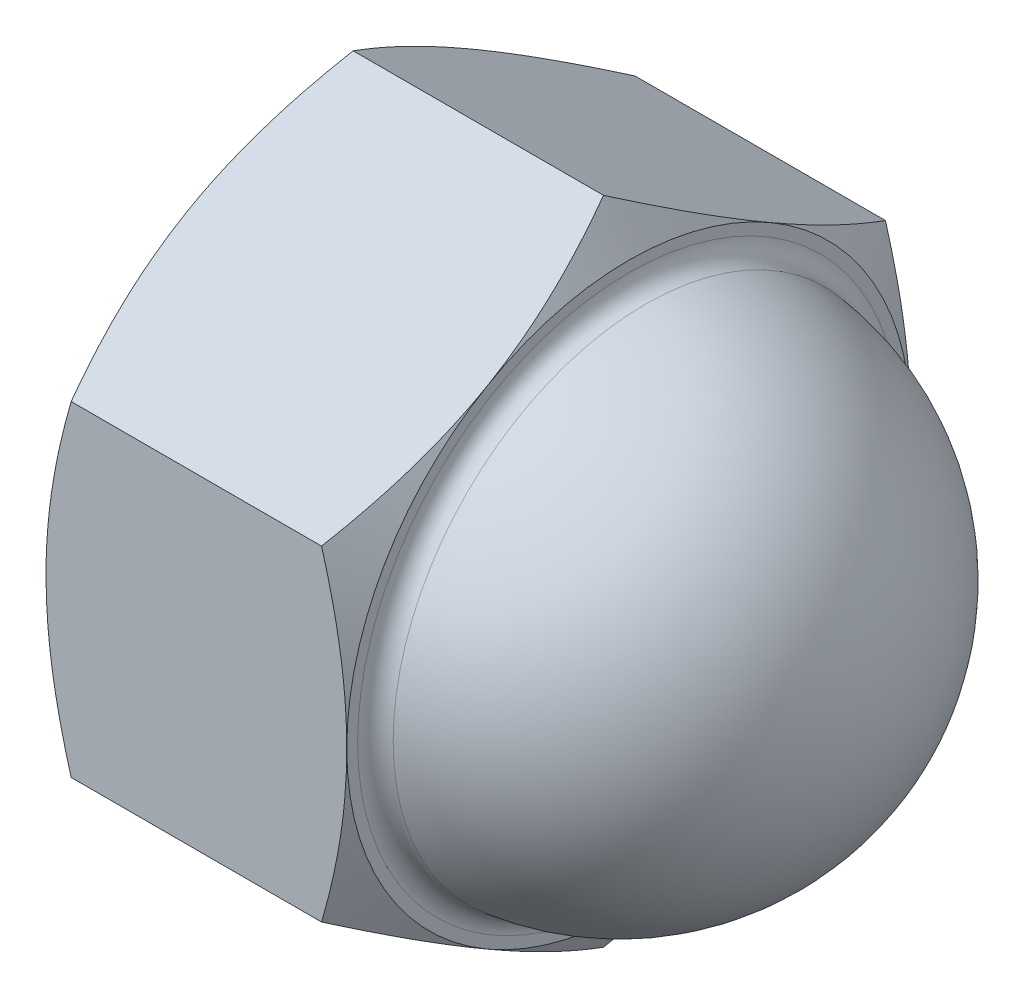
ISO-10303-21;
HEADER;
FILE_DESCRIPTION(('STEP AP214'),'2;1');
FILE_NAME('part.step','',(''),(''),'','','');
FILE_SCHEMA(('AUTOMOTIVE_DESIGN { 1 0 10303 214 1 1 1 1 }'));
ENDSEC;
DATA;
#1=APPLICATION_CONTEXT('core data for automotive mechanical design processes');
#2=APPLICATION_PROTOCOL_DEFINITION('international standard','automotive_design',2000,#1);
#3=PRODUCT_CONTEXT('',#1,'mechanical');
#4=PRODUCT('Part','Part','',(#3));
#5=PRODUCT_RELATED_PRODUCT_CATEGORY('part','',(#4));
#6=PRODUCT_DEFINITION_FORMATION('','',#4);
#7=PRODUCT_DEFINITION_CONTEXT('part definition',#1,'design');
#8=PRODUCT_DEFINITION('design','',#6,#7);
#9=PRODUCT_DEFINITION_SHAPE('','',#8);
#10=(LENGTH_UNIT() NAMED_UNIT(*) SI_UNIT(.MILLI.,.METRE.));
#11=(NAMED_UNIT(*) PLANE_ANGLE_UNIT() SI_UNIT($,.RADIAN.));
#12=(NAMED_UNIT(*) SI_UNIT($,.STERADIAN.) SOLID_ANGLE_UNIT());
#13=UNCERTAINTY_MEASURE_WITH_UNIT(LENGTH_MEASURE(1.E-05),#10,'distance_accuracy_value','');
#14=(GEOMETRIC_REPRESENTATION_CONTEXT(3) GLOBAL_UNCERTAINTY_ASSIGNED_CONTEXT((#13)) GLOBAL_UNIT_ASSIGNED_CONTEXT((#10,
#11,#12)) REPRESENTATION_CONTEXT('',''));
#15=CARTESIAN_POINT('',(0.,0.,0.));
#16=DIRECTION('',(0.,0.,1.));
#17=DIRECTION('',(1.,0.,0.));
#18=AXIS2_PLACEMENT_3D('',#15,#16,#17);
#19=CARTESIAN_POINT('',(16.,17.3205080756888,0.));
#20=DIRECTION('',(-1.,0.,0.));
#21=DIRECTION('',(0.,0.,1.));
#22=AXIS2_PLACEMENT_3D('',#19,#20,#21);
#23=PLANE('',#22);
#24=CARTESIAN_POINT('',(16.,0.,0.));
#25=DIRECTION('',(-1.,0.,0.));
#26=DIRECTION('',(0.,0.,1.));
#27=AXIS2_PLACEMENT_3D('',#24,#25,#26);
#28=CIRCLE('',#27,14.422205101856);
#29=CARTESIAN_POINT('',(16.,0.,14.422205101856));
#30=VERTEX_POINT('',#29);
#31=EDGE_CURVE('E11',#30,#30,#28,.T.);
#32=ORIENTED_EDGE('',*,*,#31,.T.);
#33=EDGE_LOOP('',(#32));
#34=FACE_BOUND('',#33,.T.);
#35=CARTESIAN_POINT('',(16.,0.,0.));
#36=DIRECTION('',(-1.,0.,0.));
#37=DIRECTION('',(0.,0.,1.));
#38=AXIS2_PLACEMENT_3D('',#35,#36,#37);
#39=CIRCLE('',#38,15.);
#40=CARTESIAN_POINT('',(16.,0.,15.));
#41=VERTEX_POINT('',#40);
#42=CARTESIAN_POINT('',(16.,12.9903810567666,7.5));
#43=VERTEX_POINT('',#42);
#44=EDGE_CURVE('E343',#41,#43,#39,.T.);
#45=ORIENTED_EDGE('',*,*,#44,.F.);
#46=CARTESIAN_POINT('',(16.,-12.9903810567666,7.50000000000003));
#47=VERTEX_POINT('',#46);
#48=EDGE_CURVE('E49',#47,#41,#39,.T.);
#49=ORIENTED_EDGE('',*,*,#48,.F.);
#50=CARTESIAN_POINT('',(16.,-12.9903810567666,-7.5));
#51=VERTEX_POINT('',#50);
#52=EDGE_CURVE('E345',#51,#47,#39,.T.);
#53=ORIENTED_EDGE('',*,*,#52,.F.);
#54=CARTESIAN_POINT('',(16.,0.,-15.));
#55=VERTEX_POINT('',#54);
#56=EDGE_CURVE('E57',#55,#51,#39,.T.);
#57=ORIENTED_EDGE('',*,*,#56,.F.);
#58=CARTESIAN_POINT('',(16.,12.9903810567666,-7.50000000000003));
#59=VERTEX_POINT('',#58);
#60=EDGE_CURVE('E333',#59,#55,#39,.T.);
#61=ORIENTED_EDGE('',*,*,#60,.F.);
#62=EDGE_CURVE('E340',#43,#59,#39,.T.);
#63=ORIENTED_EDGE('',*,*,#62,.F.);
#64=EDGE_LOOP('',(#45,#49,#53,#57,#61,#63));
#65=FACE_BOUND('',#64,.T.);
#66=ADVANCED_FACE('F34',(#34,#65),#23,.F.);
#67=CARTESIAN_POINT('',(15.5,0.,0.));
#68=DIRECTION('',(-1.,0.,0.));
#69=DIRECTION('',(0.,1.,0.));
#70=AXIS2_PLACEMENT_3D('',#67,#68,#69);
#71=SPHERICAL_SURFACE('',#70,13.5);
#72=CARTESIAN_POINT('',(16.8965517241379,0.,0.));
#73=DIRECTION('',(-1.,0.,0.));
#74=DIRECTION('',(0.,0.,1.));
#75=AXIS2_PLACEMENT_3D('',#72,#73,#74);
#76=CIRCLE('',#75,13.4275702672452);
#77=CARTESIAN_POINT('',(16.8965517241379,0.,13.4275702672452));
#78=VERTEX_POINT('',#77);
#79=EDGE_CURVE('E42',#78,#78,#76,.F.);
#80=ORIENTED_EDGE('',*,*,#79,.T.);
#81=EDGE_LOOP('',(#80));
#82=FACE_BOUND('',#81,.T.);
#83=ADVANCED_FACE('F277',(#82),#71,.T.);
#84=CARTESIAN_POINT('',(13.2168783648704,0.,0.));
#85=DIRECTION('',(-1.,0.,0.));
#86=DIRECTION('',(0.,0.,1.));
#87=AXIS2_PLACEMENT_3D('',#84,#85,#86);
#88=CONICAL_SURFACE('',#87,19.8205080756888,1.0471975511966);
#89=CARTESIAN_POINT('',(14.6601873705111,17.3206235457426,-0.000200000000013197));
#90=CARTESIAN_POINT('',(14.7700782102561,17.130274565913,0.329494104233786));
#91=CARTESIAN_POINT('',(14.8749824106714,16.939183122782,0.660474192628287));
#92=CARTESIAN_POINT('',(15.0734314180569,16.5554679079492,1.32508844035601));
#93=CARTESIAN_POINT('',(15.1669724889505,16.3628436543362,1.65872343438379));
#94=CARTESIAN_POINT('',(15.3414378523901,15.9756905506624,2.32929228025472));
#95=CARTESIAN_POINT('',(15.4223322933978,15.7811583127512,2.666232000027));
#96=CARTESIAN_POINT('',(15.5697673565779,15.3907420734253,3.34245276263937));
#97=CARTESIAN_POINT('',(15.6363087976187,15.1948581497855,3.6817336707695));
#98=CARTESIAN_POINT('',(15.7522076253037,14.8067578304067,4.3539431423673));
#99=CARTESIAN_POINT('',(15.8019486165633,14.6145702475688,4.68682180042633));
#100=CARTESIAN_POINT('',(15.8853532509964,14.2293144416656,5.35410443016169));
#101=CARTESIAN_POINT('',(15.9190165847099,14.0362462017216,5.68850843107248));
#102=CARTESIAN_POINT('',(15.9694159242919,13.6497853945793,6.35787818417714));
#103=CARTESIAN_POINT('',(15.9861720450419,13.4563934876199,6.69284279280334));
#104=CARTESIAN_POINT('',(16.002396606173,13.0694311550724,7.363081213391));
#105=CARTESIAN_POINT('',(16.0018655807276,12.8758607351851,7.69835501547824));
#106=CARTESIAN_POINT('',(15.9847233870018,12.5139822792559,8.32514688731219));
#107=CARTESIAN_POINT('',(15.970203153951,12.3456484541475,8.61670962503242));
#108=CARTESIAN_POINT('',(15.9283628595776,12.0093680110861,9.19916443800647));
#109=CARTESIAN_POINT('',(15.9010418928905,11.8414214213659,9.49005646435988));
#110=CARTESIAN_POINT('',(15.8340764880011,11.5060066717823,10.0710118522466));
#111=CARTESIAN_POINT('',(15.7944218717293,11.338539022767,10.3610743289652));
#112=CARTESIAN_POINT('',(15.7034848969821,11.0043888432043,10.939839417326));
#113=CARTESIAN_POINT('',(15.6522017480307,10.8377063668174,11.2285419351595));
#114=CARTESIAN_POINT('',(15.4796131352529,10.3317324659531,12.1049144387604));
#115=CARTESIAN_POINT('',(15.3410988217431,9.99390625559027,12.6900465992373));
#116=CARTESIAN_POINT('',(15.0267280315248,9.32329122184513,13.8515859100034));
#117=CARTESIAN_POINT('',(14.8509453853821,8.99049381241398,14.4280079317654));
#118=CARTESIAN_POINT('',(14.6601873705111,8.66013856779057,15.0002));
#119=B_SPLINE_CURVE_WITH_KNOTS('',3,(#89,#90,#91,#92,#93,#94,#95,#96,#97,#98,#99,#100,#101,#102,
#103,#104,#105,#106,#107,#108,#109,#110,#111,#112,#113,#114,#115,#116,#117,#118),.UNSPECIFIED.,
.F.,.F.,(4,2,2,2,2,2,2,2,2,2,2,2,2,2,4),(0.,1.18875411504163,2.37789802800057,3.56980778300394,
4.76164951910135,5.92407379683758,7.08652044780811,8.24758247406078,9.40860862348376,
10.4193068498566,11.4300765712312,12.4416826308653,13.4533574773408,15.5211962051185,
17.5849760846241),.UNSPECIFIED.);
#120=CARTESIAN_POINT('',(14.6602540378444,17.3205080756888,0.));
#121=VERTEX_POINT('',#120);
#122=EDGE_CURVE('E233',#121,#43,#119,.T.);
#123=ORIENTED_EDGE('',*,*,#122,.T.);
#124=ORIENTED_EDGE('',*,*,#62,.T.);
#125=CARTESIAN_POINT('',(14.6601873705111,8.66013856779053,-15.0002));
#126=CARTESIAN_POINT('',(14.7700782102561,8.85048754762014,-14.6705058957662));
#127=CARTESIAN_POINT('',(14.8749824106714,9.04157899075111,-14.3395258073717));
#128=CARTESIAN_POINT('',(15.0734314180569,9.42529420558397,-13.674911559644));
#129=CARTESIAN_POINT('',(15.1669724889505,9.61791845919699,-13.3412765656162));
#130=CARTESIAN_POINT('',(15.3414378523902,10.0050715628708,-12.6707077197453));
#131=CARTESIAN_POINT('',(15.4223322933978,10.199603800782,-12.333767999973));
#132=CARTESIAN_POINT('',(15.569767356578,10.5900200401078,-11.6575472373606));
#133=CARTESIAN_POINT('',(15.6363087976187,10.7859039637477,-11.3182663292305));
#134=CARTESIAN_POINT('',(15.7522076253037,11.1740042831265,-10.6460568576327));
#135=CARTESIAN_POINT('',(15.8019486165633,11.3661918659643,-10.3131781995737));
#136=CARTESIAN_POINT('',(15.8853532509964,11.7514476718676,-9.64589556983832));
#137=CARTESIAN_POINT('',(15.9190165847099,11.9445159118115,-9.31149156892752));
#138=CARTESIAN_POINT('',(15.9694159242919,12.3309767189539,-8.64212181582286));
#139=CARTESIAN_POINT('',(15.9861720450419,12.5243686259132,-8.30715720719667));
#140=CARTESIAN_POINT('',(16.002396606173,12.9113309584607,-7.63691878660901));
#141=CARTESIAN_POINT('',(16.0018655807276,13.104901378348,-7.30164498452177));
#142=CARTESIAN_POINT('',(15.9847233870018,13.4667798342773,-6.67485311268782));
#143=CARTESIAN_POINT('',(15.970203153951,13.6351136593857,-6.38329037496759));
#144=CARTESIAN_POINT('',(15.9283628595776,13.9713941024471,-5.80083556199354));
#145=CARTESIAN_POINT('',(15.9010418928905,14.1393406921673,-5.50994353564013));
#146=CARTESIAN_POINT('',(15.8340764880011,14.4747554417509,-4.92898814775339));
#147=CARTESIAN_POINT('',(15.7944218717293,14.6422230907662,-4.63892567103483));
#148=CARTESIAN_POINT('',(15.7034848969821,14.9763732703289,-4.06016058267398));
#149=CARTESIAN_POINT('',(15.6522017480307,15.1430557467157,-3.77145806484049));
#150=CARTESIAN_POINT('',(15.4796131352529,15.6490296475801,-2.89508556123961));
#151=CARTESIAN_POINT('',(15.3410988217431,15.9868558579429,-2.30995340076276));
#152=CARTESIAN_POINT('',(15.0267280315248,16.6574708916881,-1.14841408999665));
#153=CARTESIAN_POINT('',(14.8509453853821,16.9902683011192,-0.571992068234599));
#154=CARTESIAN_POINT('',(14.6601873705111,17.3206235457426,0.000199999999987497));
#155=B_SPLINE_CURVE_WITH_KNOTS('',3,(#125,#126,#127,#128,#129,#130,#131,#132,#133,#134,#135,
#136,#137,#138,#139,#140,#141,#142,#143,#144,#145,#146,#147,#148,#149,#150,#151,#152,#153,#154),
.UNSPECIFIED.,.F.,.F.,(4,2,2,2,2,2,2,2,2,2,2,2,2,2,4),(0.,1.18875411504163,2.37789802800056,
3.56980778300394,4.76164951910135,5.92407379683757,7.0865204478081,8.24758247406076,
9.40860862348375,10.4193068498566,11.4300765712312,12.4416826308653,13.4533574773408,
15.5211962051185,17.5849760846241),.UNSPECIFIED.);
#156=EDGE_CURVE('E149',#59,#121,#155,.T.);
#157=ORIENTED_EDGE('',*,*,#156,.T.);
#158=EDGE_LOOP('',(#123,#124,#157));
#159=FACE_BOUND('',#158,.T.);
#160=ADVANCED_FACE('F284',(#159),#88,.T.);
#161=CARTESIAN_POINT('',(14.6602540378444,8.66025403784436,-15.));
#162=VERTEX_POINT('',#161);
#163=EDGE_CURVE('E316',#162,#59,#155,.T.);
#164=ORIENTED_EDGE('',*,*,#163,.T.);
#165=ORIENTED_EDGE('',*,*,#60,.T.);
#166=CARTESIAN_POINT('',(8.72490551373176,-23.1690741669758,-15.));
#167=CARTESIAN_POINT('',(8.88346375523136,-22.8419055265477,-15.));
#168=CARTESIAN_POINT('',(9.0412242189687,-22.5143504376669,-15.));
#169=CARTESIAN_POINT('',(9.3549687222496,-21.8583866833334,-15.));
#170=CARTESIAN_POINT('',(9.51095274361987,-21.5299780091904,-15.));
#171=CARTESIAN_POINT('',(9.97601055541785,-20.5432618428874,-15.));
#172=CARTESIAN_POINT('',(10.2821423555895,-19.8835624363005,-15.));
#173=CARTESIAN_POINT('',(10.8863599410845,-18.5560823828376,-15.));
#174=CARTESIAN_POINT('',(11.1843920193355,-17.8882772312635,-15.));
#175=CARTESIAN_POINT('',(11.7681393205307,-16.5473234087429,-15.));
#176=CARTESIAN_POINT('',(12.0538551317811,-15.8741749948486,-15.));
#177=CARTESIAN_POINT('',(12.6184951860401,-14.5000785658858,-15.));
#178=CARTESIAN_POINT('',(12.8969197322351,-13.7989241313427,-15.));
#179=CARTESIAN_POINT('',(13.4324703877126,-12.3883726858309,-15.));
#180=CARTESIAN_POINT('',(13.6895940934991,-11.6789747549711,-15.));
#181=CARTESIAN_POINT('',(14.1757206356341,-10.2521895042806,-15.));
#182=CARTESIAN_POINT('',(14.4047812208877,-9.53482202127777,-15.));
#183=CARTESIAN_POINT('',(14.8273819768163,-8.08972904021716,-15.));
#184=CARTESIAN_POINT('',(15.0209334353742,-7.36200691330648,-15.));
#185=CARTESIAN_POINT('',(15.2770501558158,-6.26455118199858,-15.));
#186=CARTESIAN_POINT('',(15.3565523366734,-5.89874555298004,-15.));
#187=CARTESIAN_POINT('',(15.5031975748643,-5.16465247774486,-15.));
#188=CARTESIAN_POINT('',(15.5703408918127,-4.79636508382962,-15.));
#189=CARTESIAN_POINT('',(15.691077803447,-4.0575678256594,-15.));
#190=CARTESIAN_POINT('',(15.7446715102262,-3.6870579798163,-15.));
#191=CARTESIAN_POINT('',(15.8372361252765,-2.94421917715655,-15.));
#192=CARTESIAN_POINT('',(15.8762076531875,-2.57189029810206,-15.));
#193=CARTESIAN_POINT('',(15.9382707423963,-1.83075081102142,-15.));
#194=CARTESIAN_POINT('',(15.961561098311,-1.46195695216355,-15.));
#195=CARTESIAN_POINT('',(15.992531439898,-0.723715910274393,-15.));
#196=CARTESIAN_POINT('',(16.000211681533,-0.354268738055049,-15.));
#197=CARTESIAN_POINT('',(15.999779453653,0.384620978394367,-15.));
#198=CARTESIAN_POINT('',(15.9916668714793,0.754063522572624,-15.));
#199=CARTESIAN_POINT('',(15.9598452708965,1.49227999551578,-15.));
#200=CARTESIAN_POINT('',(15.9361355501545,1.86105389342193,-15.));
#201=CARTESIAN_POINT('',(15.8606650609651,2.75020108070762,-15.));
#202=CARTESIAN_POINT('',(15.8013447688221,3.2699437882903,-15.));
#203=CARTESIAN_POINT('',(15.6549761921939,4.30551289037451,-15.));
#204=CARTESIAN_POINT('',(15.5679240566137,4.82133873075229,-15.));
#205=CARTESIAN_POINT('',(15.3691887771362,5.84860326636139,-15.));
#206=CARTESIAN_POINT('',(15.2574861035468,6.36003814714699,-15.));
#207=CARTESIAN_POINT('',(15.0128532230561,7.37774872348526,-15.));
#208=CARTESIAN_POINT('',(14.879923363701,7.88402450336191,-15.));
#209=CARTESIAN_POINT('',(14.5929500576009,8.90245513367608,-15.));
#210=CARTESIAN_POINT('',(14.4385092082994,9.41449722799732,-15.));
#211=CARTESIAN_POINT('',(14.1138787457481,10.4335364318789,-15.));
#212=CARTESIAN_POINT('',(13.9436890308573,10.9405335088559,-15.));
#213=CARTESIAN_POINT('',(13.5902447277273,11.9497365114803,-15.));
#214=CARTESIAN_POINT('',(13.406994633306,12.4519440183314,-15.));
#215=CARTESIAN_POINT('',(13.0295649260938,13.4522120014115,-15.));
#216=CARTESIAN_POINT('',(12.8353854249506,13.9502725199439,-15.));
#217=CARTESIAN_POINT('',(12.3752305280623,15.0992288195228,-15.));
#218=CARTESIAN_POINT('',(12.105925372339,15.748788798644,-15.));
#219=CARTESIAN_POINT('',(11.5547925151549,17.0425896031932,-15.));
#220=CARTESIAN_POINT('',(11.2729641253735,17.6868301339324,-15.));
#221=CARTESIAN_POINT('',(10.6992189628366,18.9709471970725,-15.));
#222=CARTESIAN_POINT('',(10.4073001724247,19.6108228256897,-15.));
#223=CARTESIAN_POINT('',(9.81534813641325,20.8867861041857,-15.));
#224=CARTESIAN_POINT('',(9.51531504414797,21.522873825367,-15.));
#225=CARTESIAN_POINT('',(8.90830232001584,22.7925136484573,-15.));
#226=CARTESIAN_POINT('',(8.60131594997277,23.4260625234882,-15.));
#227=CARTESIAN_POINT('',(7.98185068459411,24.6904686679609,-15.));
#228=CARTESIAN_POINT('',(7.66937176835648,25.3213259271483,-15.));
#229=CARTESIAN_POINT('',(7.03987592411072,26.5806782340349,-15.));
#230=CARTESIAN_POINT('',(6.72285952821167,27.2091735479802,-15.));
#231=CARTESIAN_POINT('',(6.08497726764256,28.4642087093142,-15.));
#232=CARTESIAN_POINT('',(5.76411138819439,29.0907485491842,-15.));
#233=CARTESIAN_POINT('',(4.84852370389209,30.8671956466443,-15.));
#234=CARTESIAN_POINT('',(4.24993335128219,32.0151090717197,-15.));
#235=CARTESIAN_POINT('',(3.04449894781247,34.3066304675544,-15.));
#236=CARTESIAN_POINT('',(2.43765463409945,35.4502382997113,-15.));
#237=CARTESIAN_POINT('',(1.21904159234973,37.73139285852,-15.));
#238=CARTESIAN_POINT('',(0.607287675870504,38.8689475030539,-15.));
#239=CARTESIAN_POINT('',(-0.314051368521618,40.5732346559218,-15.));
#240=CARTESIAN_POINT('',(-0.621774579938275,41.1409752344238,-15.));
#241=CARTESIAN_POINT('',(-1.2383346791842,42.2758502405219,-15.));
#242=CARTESIAN_POINT('',(-1.54717156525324,42.8429846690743,-15.));
#243=CARTESIAN_POINT('',(-1.85650205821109,43.4098498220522,-15.));
#244=B_SPLINE_CURVE_WITH_KNOTS('',3,(#166,#167,#168,#169,#170,#171,#172,#173,#174,#175,#176,
#177,#178,#179,#180,#181,#182,#183,#184,#185,#186,#187,#188,#189,#190,#191,#192,#193,#194,#195,
#196,#197,#198,#199,#200,#201,#202,#203,#204,#205,#206,#207,#208,#209,#210,#211,#212,#213,#214,
#215,#216,#217,#218,#219,#220,#221,#222,#223,#224,#225,#226,#227,#228,#229,#230,#231,#232,#233,
#234,#235,#236,#237,#238,#239,#240,#241,#242,#243),.UNSPECIFIED.,.F.,.F.,(4,2,2,2,2,2,2,2,2,2,2,
2,2,2,2,2,2,2,2,2,2,2,2,2,2,2,2,2,2,2,2,2,2,2,2,2,2,2,4),(0.,1.09069516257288,2.18140147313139,
4.36314172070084,6.55691851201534,8.75059039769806,11.0135627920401,13.2767901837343,
15.5352791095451,17.7930488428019,18.9159095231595,20.0387466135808,21.1615744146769,
22.2843546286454,23.3926186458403,24.5008644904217,25.6091182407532,26.7174218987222,
28.2859027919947,29.8546015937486,31.4245477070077,32.9944681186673,34.5986435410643,
36.2028293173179,37.8064657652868,39.4100858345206,41.5194319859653,43.6288942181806,
45.7387807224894,47.8486273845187,49.9606143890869,52.0726094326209,54.1843587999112,
56.2961162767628,60.1798964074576,64.0638005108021,67.9386334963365,69.8759519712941,
71.8132673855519),.UNSPECIFIED.);
#245=EDGE_CURVE('E227',#162,#55,#244,.F.);
#246=ORIENTED_EDGE('',*,*,#245,.F.);
#247=EDGE_LOOP('',(#164,#165,#246));
#248=FACE_BOUND('',#247,.T.);
#249=ADVANCED_FACE('F195',(#248),#88,.T.);
#250=CARTESIAN_POINT('',(14.6601873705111,-17.3206235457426,0.000200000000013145));
#251=CARTESIAN_POINT('',(14.7700782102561,-17.130274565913,-0.329494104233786));
#252=CARTESIAN_POINT('',(14.8749824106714,-16.939183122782,-0.660474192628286));
#253=CARTESIAN_POINT('',(15.0734314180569,-16.5554679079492,-1.325088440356));
#254=CARTESIAN_POINT('',(15.1669724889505,-16.3628436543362,-1.65872343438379));
#255=CARTESIAN_POINT('',(15.3414378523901,-15.9756905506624,-2.32929228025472));
#256=CARTESIAN_POINT('',(15.4223322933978,-15.7811583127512,-2.666232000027));
#257=CARTESIAN_POINT('',(15.5697673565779,-15.3907420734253,-3.34245276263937));
#258=CARTESIAN_POINT('',(15.6363087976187,-15.1948581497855,-3.6817336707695));
#259=CARTESIAN_POINT('',(15.7522076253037,-14.8067578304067,-4.35394314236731));
#260=CARTESIAN_POINT('',(15.8019486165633,-14.6145702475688,-4.68682180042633));
#261=CARTESIAN_POINT('',(15.8853532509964,-14.2293144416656,-5.35410443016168));
#262=CARTESIAN_POINT('',(15.9190165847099,-14.0362462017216,-5.68850843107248));
#263=CARTESIAN_POINT('',(15.9694159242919,-13.6497853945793,-6.35787818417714));
#264=CARTESIAN_POINT('',(15.9861720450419,-13.4563934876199,-6.69284279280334));
#265=CARTESIAN_POINT('',(16.002396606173,-13.0694311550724,-7.363081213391));
#266=CARTESIAN_POINT('',(16.0018655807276,-12.8758607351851,-7.69835501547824));
#267=CARTESIAN_POINT('',(15.9847233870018,-12.5139822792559,-8.32514688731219));
#268=CARTESIAN_POINT('',(15.970203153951,-12.3456484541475,-8.61670962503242));
#269=CARTESIAN_POINT('',(15.9283628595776,-12.0093680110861,-9.19916443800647));
#270=CARTESIAN_POINT('',(15.9010418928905,-11.8414214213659,-9.49005646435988));
#271=CARTESIAN_POINT('',(15.8340764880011,-11.5060066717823,-10.0710118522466));
#272=CARTESIAN_POINT('',(15.7944218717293,-11.338539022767,-10.3610743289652));
#273=CARTESIAN_POINT('',(15.7034848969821,-11.0043888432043,-10.939839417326));
#274=CARTESIAN_POINT('',(15.6522017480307,-10.8377063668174,-11.2285419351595));
#275=CARTESIAN_POINT('',(15.4796131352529,-10.3317324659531,-12.1049144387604));
#276=CARTESIAN_POINT('',(15.3410988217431,-9.99390625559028,-12.6900465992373));
#277=CARTESIAN_POINT('',(15.0267280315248,-9.32329122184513,-13.8515859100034));
#278=CARTESIAN_POINT('',(14.8509453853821,-8.99049381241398,-14.4280079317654));
#279=CARTESIAN_POINT('',(14.6601873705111,-8.66013856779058,-15.0002));
#280=B_SPLINE_CURVE_WITH_KNOTS('',3,(#250,#251,#252,#253,#254,#255,#256,#257,#258,#259,#260,
#261,#262,#263,#264,#265,#266,#267,#268,#269,#270,#271,#272,#273,#274,#275,#276,#277,#278,#279),
.UNSPECIFIED.,.F.,.F.,(4,2,2,2,2,2,2,2,2,2,2,2,2,2,4),(0.,1.18875411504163,2.37789802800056,
3.56980778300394,4.76164951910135,5.92407379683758,7.08652044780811,8.24758247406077,
9.40860862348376,10.4193068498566,11.4300765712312,12.4416826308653,13.4533574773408,
15.5211962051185,17.5849760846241),.UNSPECIFIED.);
#281=CARTESIAN_POINT('',(14.6602540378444,-8.66025403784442,-15.));
#282=VERTEX_POINT('',#281);
#283=EDGE_CURVE('E245',#51,#282,#280,.T.);
#284=ORIENTED_EDGE('',*,*,#283,.T.);
#285=EDGE_CURVE('E235',#55,#282,#244,.F.);
#286=ORIENTED_EDGE('',*,*,#285,.F.);
#287=ORIENTED_EDGE('',*,*,#56,.T.);
#288=EDGE_LOOP('',(#284,#286,#287));
#289=FACE_BOUND('',#288,.T.);
#290=ADVANCED_FACE('F423',(#289),#88,.T.);
#291=CARTESIAN_POINT('',(14.6601873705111,-8.66013856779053,15.0002));
#292=CARTESIAN_POINT('',(14.7700782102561,-8.85048754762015,14.6705058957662));
#293=CARTESIAN_POINT('',(14.8749824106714,-9.04157899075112,14.3395258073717));
#294=CARTESIAN_POINT('',(15.0734314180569,-9.42529420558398,13.674911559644));
#295=CARTESIAN_POINT('',(15.1669724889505,-9.617918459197,13.3412765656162));
#296=CARTESIAN_POINT('',(15.3414378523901,-10.0050715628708,12.6707077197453));
#297=CARTESIAN_POINT('',(15.4223322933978,-10.199603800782,12.333767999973));
#298=CARTESIAN_POINT('',(15.569767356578,-10.5900200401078,11.6575472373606));
#299=CARTESIAN_POINT('',(15.6363087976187,-10.7859039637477,11.3182663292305));
#300=CARTESIAN_POINT('',(15.7522076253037,-11.1740042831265,10.6460568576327));
#301=CARTESIAN_POINT('',(15.8019486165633,-11.3661918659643,10.3131781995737));
#302=CARTESIAN_POINT('',(15.8853532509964,-11.7514476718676,9.64589556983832));
#303=CARTESIAN_POINT('',(15.9190165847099,-11.9445159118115,9.31149156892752));
#304=CARTESIAN_POINT('',(15.9694159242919,-12.3309767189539,8.64212181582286));
#305=CARTESIAN_POINT('',(15.9861720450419,-12.5243686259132,8.30715720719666));
#306=CARTESIAN_POINT('',(16.002396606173,-12.9113309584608,7.63691878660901));
#307=CARTESIAN_POINT('',(16.0018655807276,-13.1049013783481,7.30164498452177));
#308=CARTESIAN_POINT('',(15.9847233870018,-13.4667798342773,6.67485311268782));
#309=CARTESIAN_POINT('',(15.970203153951,-13.6351136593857,6.38329037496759));
#310=CARTESIAN_POINT('',(15.9283628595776,-13.9713941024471,5.80083556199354));
#311=CARTESIAN_POINT('',(15.9010418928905,-14.1393406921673,5.50994353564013));
#312=CARTESIAN_POINT('',(15.8340764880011,-14.4747554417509,4.92898814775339));
#313=CARTESIAN_POINT('',(15.7944218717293,-14.6422230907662,4.63892567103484));
#314=CARTESIAN_POINT('',(15.7034848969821,-14.9763732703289,4.06016058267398));
#315=CARTESIAN_POINT('',(15.6522017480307,-15.1430557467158,3.77145806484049));
#316=CARTESIAN_POINT('',(15.4796131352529,-15.6490296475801,2.89508556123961));
#317=CARTESIAN_POINT('',(15.3410988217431,-15.9868558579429,2.30995340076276));
#318=CARTESIAN_POINT('',(15.0267280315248,-16.6574708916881,1.14841408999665));
#319=CARTESIAN_POINT('',(14.8509453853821,-16.9902683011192,0.571992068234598));
#320=CARTESIAN_POINT('',(14.6601873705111,-17.3206235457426,-0.000199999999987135));
#321=B_SPLINE_CURVE_WITH_KNOTS('',3,(#291,#292,#293,#294,#295,#296,#297,#298,#299,#300,#301,
#302,#303,#304,#305,#306,#307,#308,#309,#310,#311,#312,#313,#314,#315,#316,#317,#318,#319,#320),
.UNSPECIFIED.,.F.,.F.,(4,2,2,2,2,2,2,2,2,2,2,2,2,2,4),(0.,1.18875411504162,2.37789802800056,
3.56980778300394,4.76164951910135,5.92407379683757,7.0865204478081,8.24758247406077,
9.40860862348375,10.4193068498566,11.4300765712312,12.4416826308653,13.4533574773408,
15.5211962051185,17.5849760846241),.UNSPECIFIED.);
#322=CARTESIAN_POINT('',(14.6602540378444,-17.3205080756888,0.));
#323=VERTEX_POINT('',#322);
#324=EDGE_CURVE('E251',#47,#323,#321,.T.);
#325=ORIENTED_EDGE('',*,*,#324,.T.);
#326=EDGE_CURVE('E250',#323,#51,#280,.T.);
#327=ORIENTED_EDGE('',*,*,#326,.T.);
#328=ORIENTED_EDGE('',*,*,#52,.T.);
#329=EDGE_LOOP('',(#325,#327,#328));
#330=FACE_BOUND('',#329,.T.);
#331=ADVANCED_FACE('F413',(#330),#88,.T.);
#332=CARTESIAN_POINT('',(8.72490551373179,-23.1690741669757,15.));
#333=CARTESIAN_POINT('',(8.88346375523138,-22.8419055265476,15.));
#334=CARTESIAN_POINT('',(9.04122421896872,-22.5143504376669,15.));
#335=CARTESIAN_POINT('',(9.35496872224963,-21.8583866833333,15.));
#336=CARTESIAN_POINT('',(9.5109527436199,-21.5299780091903,15.));
#337=CARTESIAN_POINT('',(9.97601055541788,-20.5432618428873,15.));
#338=CARTESIAN_POINT('',(10.2821423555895,-19.8835624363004,15.));
#339=CARTESIAN_POINT('',(10.8863599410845,-18.5560823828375,15.));
#340=CARTESIAN_POINT('',(11.1843920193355,-17.8882772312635,15.));
#341=CARTESIAN_POINT('',(11.7681393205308,-16.5473234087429,15.));
#342=CARTESIAN_POINT('',(12.0538551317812,-15.8741749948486,15.));
#343=CARTESIAN_POINT('',(12.6184951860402,-14.5000785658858,15.));
#344=CARTESIAN_POINT('',(12.8969197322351,-13.7989241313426,15.));
#345=CARTESIAN_POINT('',(13.4324703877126,-12.3883726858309,15.));
#346=CARTESIAN_POINT('',(13.6895940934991,-11.6789747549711,15.));
#347=CARTESIAN_POINT('',(14.1757206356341,-10.2521895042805,15.));
#348=CARTESIAN_POINT('',(14.4047812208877,-9.53482202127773,15.));
#349=CARTESIAN_POINT('',(14.8273819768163,-8.08972904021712,15.));
#350=CARTESIAN_POINT('',(15.0209334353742,-7.36200691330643,15.));
#351=CARTESIAN_POINT('',(15.2770501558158,-6.26455118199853,15.));
#352=CARTESIAN_POINT('',(15.3565523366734,-5.89874555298,15.));
#353=CARTESIAN_POINT('',(15.5031975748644,-5.16465247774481,15.));
#354=CARTESIAN_POINT('',(15.5703408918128,-4.79636508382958,15.));
#355=CARTESIAN_POINT('',(15.691077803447,-4.05756782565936,15.));
#356=CARTESIAN_POINT('',(15.7446715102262,-3.68705797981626,15.));
#357=CARTESIAN_POINT('',(15.8372361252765,-2.94421917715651,15.));
#358=CARTESIAN_POINT('',(15.8762076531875,-2.57189029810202,15.));
#359=CARTESIAN_POINT('',(15.9382707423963,-1.83075081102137,15.));
#360=CARTESIAN_POINT('',(15.961561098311,-1.46195695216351,15.));
#361=CARTESIAN_POINT('',(15.992531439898,-0.723715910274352,15.));
#362=CARTESIAN_POINT('',(16.000211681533,-0.35426873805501,15.));
#363=CARTESIAN_POINT('',(15.999779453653,0.384620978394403,15.));
#364=CARTESIAN_POINT('',(15.9916668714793,0.754063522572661,15.));
#365=CARTESIAN_POINT('',(15.9598452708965,1.49227999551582,15.));
#366=CARTESIAN_POINT('',(15.9361355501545,1.86105389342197,15.));
#367=CARTESIAN_POINT('',(15.8606650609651,2.75020108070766,15.));
#368=CARTESIAN_POINT('',(15.8013447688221,3.26994378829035,15.));
#369=CARTESIAN_POINT('',(15.6549761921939,4.30551289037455,15.));
#370=CARTESIAN_POINT('',(15.5679240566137,4.82133873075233,15.));
#371=CARTESIAN_POINT('',(15.3691887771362,5.84860326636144,15.));
#372=CARTESIAN_POINT('',(15.2574861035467,6.36003814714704,15.));
#373=CARTESIAN_POINT('',(15.0128532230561,7.37774872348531,15.));
#374=CARTESIAN_POINT('',(14.8799233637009,7.88402450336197,15.));
#375=CARTESIAN_POINT('',(14.5929500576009,8.90245513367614,15.));
#376=CARTESIAN_POINT('',(14.4385092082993,9.41449722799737,15.));
#377=CARTESIAN_POINT('',(14.113878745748,10.4335364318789,15.));
#378=CARTESIAN_POINT('',(13.9436890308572,10.9405335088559,15.));
#379=CARTESIAN_POINT('',(13.5902447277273,11.9497365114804,15.));
#380=CARTESIAN_POINT('',(13.406994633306,12.4519440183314,15.));
#381=CARTESIAN_POINT('',(13.0295649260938,13.4522120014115,15.));
#382=CARTESIAN_POINT('',(12.8353854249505,13.9502725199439,15.));
#383=CARTESIAN_POINT('',(12.3752305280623,15.0992288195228,15.));
#384=CARTESIAN_POINT('',(12.105925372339,15.7487887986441,15.));
#385=CARTESIAN_POINT('',(11.5547925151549,17.0425896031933,15.));
#386=CARTESIAN_POINT('',(11.2729641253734,17.6868301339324,15.));
#387=CARTESIAN_POINT('',(10.6992189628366,18.9709471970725,15.));
#388=CARTESIAN_POINT('',(10.4073001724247,19.6108228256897,15.));
#389=CARTESIAN_POINT('',(9.81534813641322,20.8867861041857,15.));
#390=CARTESIAN_POINT('',(9.51531504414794,21.522873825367,15.));
#391=CARTESIAN_POINT('',(8.90830232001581,22.7925136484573,15.));
#392=CARTESIAN_POINT('',(8.60131594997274,23.4260625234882,15.));
#393=CARTESIAN_POINT('',(7.98185068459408,24.6904686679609,15.));
#394=CARTESIAN_POINT('',(7.66937176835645,25.3213259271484,15.));
#395=CARTESIAN_POINT('',(7.03987592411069,26.580678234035,15.));
#396=CARTESIAN_POINT('',(6.72285952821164,27.2091735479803,15.));
#397=CARTESIAN_POINT('',(6.08497726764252,28.4642087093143,15.));
#398=CARTESIAN_POINT('',(5.76411138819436,29.0907485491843,15.));
#399=CARTESIAN_POINT('',(4.84852370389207,30.8671956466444,15.));
#400=CARTESIAN_POINT('',(4.24993335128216,32.0151090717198,15.));
#401=CARTESIAN_POINT('',(3.04449894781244,34.3066304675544,15.));
#402=CARTESIAN_POINT('',(2.43765463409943,35.4502382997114,15.));
#403=CARTESIAN_POINT('',(1.2190415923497,37.73139285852,15.));
#404=CARTESIAN_POINT('',(0.60728767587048,38.868947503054,15.));
#405=CARTESIAN_POINT('',(-0.314051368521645,40.5732346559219,15.));
#406=CARTESIAN_POINT('',(-0.621774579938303,41.1409752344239,15.));
#407=CARTESIAN_POINT('',(-1.23833467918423,42.275850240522,15.));
#408=CARTESIAN_POINT('',(-1.54717156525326,42.8429846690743,15.));
#409=CARTESIAN_POINT('',(-1.85650205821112,43.4098498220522,15.));
#410=B_SPLINE_CURVE_WITH_KNOTS('',3,(#332,#333,#334,#335,#336,#337,#338,#339,#340,#341,#342,
#343,#344,#345,#346,#347,#348,#349,#350,#351,#352,#353,#354,#355,#356,#357,#358,#359,#360,#361,
#362,#363,#364,#365,#366,#367,#368,#369,#370,#371,#372,#373,#374,#375,#376,#377,#378,#379,#380,
#381,#382,#383,#384,#385,#386,#387,#388,#389,#390,#391,#392,#393,#394,#395,#396,#397,#398,#399,
#400,#401,#402,#403,#404,#405,#406,#407,#408,#409),.UNSPECIFIED.,.F.,.F.,(4,2,2,2,2,2,2,2,2,2,2,
2,2,2,2,2,2,2,2,2,2,2,2,2,2,2,2,2,2,2,2,2,2,2,2,2,2,2,4),(0.,1.09069516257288,2.18140147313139,
4.36314172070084,6.55691851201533,8.75059039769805,11.0135627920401,13.2767901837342,
15.5352791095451,17.7930488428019,18.9159095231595,20.0387466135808,21.1615744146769,
22.2843546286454,23.3926186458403,24.5008644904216,25.6091182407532,26.7174218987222,
28.2859027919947,29.8546015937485,31.4245477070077,32.9944681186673,34.5986435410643,
36.2028293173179,37.8064657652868,39.4100858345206,41.5194319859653,43.6288942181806,
45.7387807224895,47.8486273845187,49.9606143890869,52.0726094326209,54.1843587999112,
56.2961162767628,60.1798964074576,64.063800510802,67.9386334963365,69.8759519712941,
71.8132673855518),.UNSPECIFIED.);
#411=CARTESIAN_POINT('',(14.6602540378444,-8.66025403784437,15.));
#412=VERTEX_POINT('',#411);
#413=EDGE_CURVE('E257',#41,#412,#410,.F.);
#414=ORIENTED_EDGE('',*,*,#413,.T.);
#415=EDGE_CURVE('E256',#412,#47,#321,.T.);
#416=ORIENTED_EDGE('',*,*,#415,.T.);
#417=ORIENTED_EDGE('',*,*,#48,.T.);
#418=EDGE_LOOP('',(#414,#416,#417));
#419=FACE_BOUND('',#418,.T.);
#420=ADVANCED_FACE('F411',(#419),#88,.T.);
#421=CARTESIAN_POINT('',(14.6602540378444,8.66025403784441,15.));
#422=VERTEX_POINT('',#421);
#423=EDGE_CURVE('E244',#43,#422,#119,.T.);
#424=ORIENTED_EDGE('',*,*,#423,.T.);
#425=EDGE_CURVE('E408',#422,#41,#410,.F.);
#426=ORIENTED_EDGE('',*,*,#425,.T.);
#427=ORIENTED_EDGE('',*,*,#44,.T.);
#428=EDGE_LOOP('',(#424,#426,#427));
#429=FACE_BOUND('',#428,.T.);
#430=ADVANCED_FACE('F416',(#429),#88,.T.);
#431=CARTESIAN_POINT('',(16.,8.66025403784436,-15.));
#432=DIRECTION('',(0.,-0.866025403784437,0.500000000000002));
#433=DIRECTION('',(0.,-0.500000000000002,-0.866025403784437));
#434=AXIS2_PLACEMENT_3D('',#431,#432,#433);
#435=PLANE('',#434);
#436=ORIENTED_EDGE('',*,*,#163,.F.);
#437=DIRECTION('',(-1.,0.,0.));
#438=VECTOR('',#437,1.);
#439=CARTESIAN_POINT('',(16.,8.66025403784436,-15.));
#440=LINE('',#439,#438);
#441=CARTESIAN_POINT('',(1.33974596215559,8.66025403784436,-15.));
#442=VERTEX_POINT('',#441);
#443=EDGE_CURVE('E407',#162,#442,#440,.T.);
#444=ORIENTED_EDGE('',*,*,#443,.T.);
#445=CARTESIAN_POINT('',(1.33981262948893,17.3206235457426,0.000199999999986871));
#446=CARTESIAN_POINT('',(1.22992178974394,17.130274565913,-0.329494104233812));
#447=CARTESIAN_POINT('',(1.12501758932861,16.939183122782,-0.660474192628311));
#448=CARTESIAN_POINT('',(0.926568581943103,16.5554679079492,-1.32508844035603));
#449=CARTESIAN_POINT('',(0.833027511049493,16.3628436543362,-1.65872343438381));
#450=CARTESIAN_POINT('',(0.658562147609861,15.9756905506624,-2.32929228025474));
#451=CARTESIAN_POINT('',(0.577667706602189,15.7811583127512,-2.66623200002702));
#452=CARTESIAN_POINT('',(0.430232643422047,15.3907420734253,-3.34245276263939));
#453=CARTESIAN_POINT('',(0.363691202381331,15.1948581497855,-3.68173367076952));
#454=CARTESIAN_POINT('',(0.247792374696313,14.8067578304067,-4.35394314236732));
#455=CARTESIAN_POINT('',(0.198051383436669,14.6145702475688,-4.68682180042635));
#456=CARTESIAN_POINT('',(0.114646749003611,14.2293144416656,-5.3541044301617));
#457=CARTESIAN_POINT('',(0.0809834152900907,14.0362462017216,-5.6885084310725));
#458=CARTESIAN_POINT('',(0.0305840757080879,13.6497853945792,-6.35787818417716));
#459=CARTESIAN_POINT('',(0.0138279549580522,13.4563934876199,-6.69284279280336));
#460=CARTESIAN_POINT('',(-0.00239660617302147,13.0694311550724,-7.36308121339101));
#461=CARTESIAN_POINT('',(-0.0018655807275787,12.8758607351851,-7.69835501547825));
#462=CARTESIAN_POINT('',(0.0152766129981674,12.5139822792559,-8.32514688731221));
#463=CARTESIAN_POINT('',(0.0297968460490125,12.3456484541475,-8.61670962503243));
#464=CARTESIAN_POINT('',(0.071637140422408,12.0093680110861,-9.19916443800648));
#465=CARTESIAN_POINT('',(0.098958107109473,11.8414214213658,-9.49005646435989));
#466=CARTESIAN_POINT('',(0.1659235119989,11.5060066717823,-10.0710118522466));
#467=CARTESIAN_POINT('',(0.205578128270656,11.338539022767,-10.3610743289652));
#468=CARTESIAN_POINT('',(0.296515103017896,11.0043888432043,-10.939839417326));
#469=CARTESIAN_POINT('',(0.34779825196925,10.8377063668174,-11.2285419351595));
#470=CARTESIAN_POINT('',(0.520386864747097,10.331732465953,-12.1049144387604));
#471=CARTESIAN_POINT('',(0.658901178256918,9.99390625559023,-12.6900465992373));
#472=CARTESIAN_POINT('',(0.973271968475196,9.32329122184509,-13.8515859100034));
#473=CARTESIAN_POINT('',(1.14905461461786,8.99049381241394,-14.4280079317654));
#474=CARTESIAN_POINT('',(1.33981262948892,8.66013856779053,-15.0002));
#475=B_SPLINE_CURVE_WITH_KNOTS('',3,(#445,#446,#447,#448,#449,#450,#451,#452,#453,#454,#455,
#456,#457,#458,#459,#460,#461,#462,#463,#464,#465,#466,#467,#468,#469,#470,#471,#472,#473,#474),
.UNSPECIFIED.,.F.,.F.,(4,2,2,2,2,2,2,2,2,2,2,2,2,2,4),(0.,1.18875411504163,2.37789802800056,
3.56980778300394,4.76164951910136,5.92407379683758,7.08652044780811,8.24758247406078,
9.40860862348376,10.4193068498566,11.4300765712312,12.4416826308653,13.4533574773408,
15.5211962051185,17.5849760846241),.UNSPECIFIED.);
#476=CARTESIAN_POINT('',(0.,12.9903810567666,-7.50000000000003));
#477=VERTEX_POINT('',#476);
#478=EDGE_CURVE('E201',#477,#442,#475,.T.);
#479=ORIENTED_EDGE('',*,*,#478,.F.);
#480=CARTESIAN_POINT('',(1.3397459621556,17.3205080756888,0.));
#481=VERTEX_POINT('',#480);
#482=EDGE_CURVE('E144',#481,#477,#475,.T.);
#483=ORIENTED_EDGE('',*,*,#482,.F.);
#484=DIRECTION('',(-1.,0.,0.));
#485=VECTOR('',#484,1.);
#486=CARTESIAN_POINT('',(16.,17.3205080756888,0.));
#487=LINE('',#486,#485);
#488=EDGE_CURVE('E163',#121,#481,#487,.T.);
#489=ORIENTED_EDGE('',*,*,#488,.F.);
#490=ORIENTED_EDGE('',*,*,#156,.F.);
#491=EDGE_LOOP('',(#436,#444,#479,#483,#489,#490));
#492=FACE_BOUND('',#491,.T.);
#493=ADVANCED_FACE('F220',(#492),#435,.F.);
#494=CARTESIAN_POINT('',(16.,8.66025403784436,-15.));
#495=DIRECTION('',(0.,0.,-1.));
#496=DIRECTION('',(-1.,0.,0.));
#497=AXIS2_PLACEMENT_3D('',#494,#495,#496);
#498=PLANE('',#497);
#499=ORIENTED_EDGE('',*,*,#443,.F.);
#500=ORIENTED_EDGE('',*,*,#245,.T.);
#501=ORIENTED_EDGE('',*,*,#285,.T.);
#502=DIRECTION('',(-1.,0.,0.));
#503=VECTOR('',#502,1.);
#504=CARTESIAN_POINT('',(16.,-8.66025403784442,-15.));
#505=LINE('',#504,#503);
#506=CARTESIAN_POINT('',(1.3397459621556,-8.66025403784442,-15.));
#507=VERTEX_POINT('',#506);
#508=EDGE_CURVE('E402',#282,#507,#505,.T.);
#509=ORIENTED_EDGE('',*,*,#508,.T.);
#510=CARTESIAN_POINT('',(7.27509448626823,-23.1690741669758,-15.));
#511=CARTESIAN_POINT('',(7.11653624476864,-22.8419055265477,-15.));
#512=CARTESIAN_POINT('',(6.9587757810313,-22.5143504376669,-15.));
#513=CARTESIAN_POINT('',(6.64503127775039,-21.8583866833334,-15.));
#514=CARTESIAN_POINT('',(6.48904725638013,-21.5299780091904,-15.));
#515=CARTESIAN_POINT('',(6.02398944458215,-20.5432618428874,-15.));
#516=CARTESIAN_POINT('',(5.71785764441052,-19.8835624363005,-15.));
#517=CARTESIAN_POINT('',(5.11364005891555,-18.5560823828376,-15.));
#518=CARTESIAN_POINT('',(4.81560798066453,-17.8882772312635,-15.));
#519=CARTESIAN_POINT('',(4.23186067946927,-16.5473234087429,-15.));
#520=CARTESIAN_POINT('',(3.94614486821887,-15.8741749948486,-15.));
#521=CARTESIAN_POINT('',(3.38150481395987,-14.5000785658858,-15.));
#522=CARTESIAN_POINT('',(3.10308026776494,-13.7989241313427,-15.));
#523=CARTESIAN_POINT('',(2.56752961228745,-12.3883726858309,-15.));
#524=CARTESIAN_POINT('',(2.31040590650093,-11.6789747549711,-15.));
#525=CARTESIAN_POINT('',(1.82427936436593,-10.2521895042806,-15.));
#526=CARTESIAN_POINT('',(1.59521877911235,-9.53482202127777,-15.));
#527=CARTESIAN_POINT('',(1.1726180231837,-8.08972904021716,-15.));
#528=CARTESIAN_POINT('',(0.97906656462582,-7.36200691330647,-15.));
#529=CARTESIAN_POINT('',(0.722949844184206,-6.26455118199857,-15.));
#530=CARTESIAN_POINT('',(0.643447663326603,-5.89874555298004,-15.));
#531=CARTESIAN_POINT('',(0.496802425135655,-5.16465247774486,-15.));
#532=CARTESIAN_POINT('',(0.429659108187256,-4.79636508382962,-15.));
#533=CARTESIAN_POINT('',(0.308922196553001,-4.0575678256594,-15.));
#534=CARTESIAN_POINT('',(0.255328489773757,-3.6870579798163,-15.));
#535=CARTESIAN_POINT('',(0.162763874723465,-2.94421917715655,-15.));
#536=CARTESIAN_POINT('',(0.123792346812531,-2.57189029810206,-15.));
#537=CARTESIAN_POINT('',(0.0617292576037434,-1.83075081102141,-15.));
#538=CARTESIAN_POINT('',(0.0384389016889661,-1.46195695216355,-15.));
#539=CARTESIAN_POINT('',(0.00746856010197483,-0.723715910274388,-15.));
#540=CARTESIAN_POINT('',(-0.000211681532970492,-0.354268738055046,-15.));
#541=CARTESIAN_POINT('',(0.00022054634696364,0.384620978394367,-15.));
#542=CARTESIAN_POINT('',(0.00833312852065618,0.754063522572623,-15.));
#543=CARTESIAN_POINT('',(0.0401547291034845,1.49227999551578,-15.));
#544=CARTESIAN_POINT('',(0.0638644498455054,1.86105389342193,-15.));
#545=CARTESIAN_POINT('',(0.139334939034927,2.75020108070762,-15.));
#546=CARTESIAN_POINT('',(0.198655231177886,3.26994378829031,-15.));
#547=CARTESIAN_POINT('',(0.345023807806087,4.30551289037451,-15.));
#548=CARTESIAN_POINT('',(0.432075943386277,4.82133873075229,-15.));
#549=CARTESIAN_POINT('',(0.630811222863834,5.84860326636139,-15.));
#550=CARTESIAN_POINT('',(0.74251389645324,6.36003814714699,-15.));
#551=CARTESIAN_POINT('',(0.987146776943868,7.37774872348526,-15.));
#552=CARTESIAN_POINT('',(1.12007663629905,7.88402450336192,-15.));
#553=CARTESIAN_POINT('',(1.40704994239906,8.90245513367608,-15.));
#554=CARTESIAN_POINT('',(1.56149079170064,9.41449722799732,-15.));
#555=CARTESIAN_POINT('',(1.88612125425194,10.4335364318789,-15.));
#556=CARTESIAN_POINT('',(2.05631096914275,10.9405335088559,-15.));
#557=CARTESIAN_POINT('',(2.40975527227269,11.9497365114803,-15.));
#558=CARTESIAN_POINT('',(2.59300536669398,12.4519440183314,-15.));
#559=CARTESIAN_POINT('',(2.97043507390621,13.4522120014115,-15.));
#560=CARTESIAN_POINT('',(3.16461457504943,13.9502725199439,-15.));
#561=CARTESIAN_POINT('',(3.62476947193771,15.0992288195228,-15.));
#562=CARTESIAN_POINT('',(3.89407462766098,15.748788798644,-15.));
#563=CARTESIAN_POINT('',(4.44520748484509,17.0425896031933,-15.));
#564=CARTESIAN_POINT('',(4.72703587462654,17.6868301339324,-15.));
#565=CARTESIAN_POINT('',(5.3007810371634,18.9709471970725,-15.));
#566=CARTESIAN_POINT('',(5.59269982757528,19.6108228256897,-15.));
#567=CARTESIAN_POINT('',(6.18465186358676,20.8867861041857,-15.));
#568=CARTESIAN_POINT('',(6.48468495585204,21.522873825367,-15.));
#569=CARTESIAN_POINT('',(7.09169767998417,22.7925136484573,-15.));
#570=CARTESIAN_POINT('',(7.39868405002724,23.4260625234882,-15.));
#571=CARTESIAN_POINT('',(8.0181493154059,24.6904686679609,-15.));
#572=CARTESIAN_POINT('',(8.33062823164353,25.3213259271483,-15.));
#573=CARTESIAN_POINT('',(8.96012407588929,26.5806782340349,-15.));
#574=CARTESIAN_POINT('',(9.27714047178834,27.2091735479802,-15.));
#575=CARTESIAN_POINT('',(9.91502273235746,28.4642087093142,-15.));
#576=CARTESIAN_POINT('',(10.2358886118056,29.0907485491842,-15.));
#577=CARTESIAN_POINT('',(11.1514762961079,30.8671956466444,-15.));
#578=CARTESIAN_POINT('',(11.7500666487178,32.0151090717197,-15.));
#579=CARTESIAN_POINT('',(12.9555010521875,34.3066304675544,-15.));
#580=CARTESIAN_POINT('',(13.5623453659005,35.4502382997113,-15.));
#581=CARTESIAN_POINT('',(14.7809584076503,37.73139285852,-15.));
#582=CARTESIAN_POINT('',(15.3927123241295,38.8689475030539,-15.));
#583=CARTESIAN_POINT('',(16.3140513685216,40.5732346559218,-15.));
#584=CARTESIAN_POINT('',(16.6217745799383,41.1409752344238,-15.));
#585=CARTESIAN_POINT('',(17.2383346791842,42.2758502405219,-15.));
#586=CARTESIAN_POINT('',(17.5471715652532,42.8429846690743,-15.));
#587=CARTESIAN_POINT('',(17.8565020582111,43.4098498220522,-15.));
#588=B_SPLINE_CURVE_WITH_KNOTS('',3,(#510,#511,#512,#513,#514,#515,#516,#517,#518,#519,#520,
#521,#522,#523,#524,#525,#526,#527,#528,#529,#530,#531,#532,#533,#534,#535,#536,#537,#538,#539,
#540,#541,#542,#543,#544,#545,#546,#547,#548,#549,#550,#551,#552,#553,#554,#555,#556,#557,#558,
#559,#560,#561,#562,#563,#564,#565,#566,#567,#568,#569,#570,#571,#572,#573,#574,#575,#576,#577,
#578,#579,#580,#581,#582,#583,#584,#585,#586,#587),.UNSPECIFIED.,.F.,.F.,(4,2,2,2,2,2,2,2,2,2,2,
2,2,2,2,2,2,2,2,2,2,2,2,2,2,2,2,2,2,2,2,2,2,2,2,2,2,2,4),(0.,1.09069516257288,2.18140147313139,
4.36314172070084,6.55691851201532,8.75059039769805,11.0135627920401,13.2767901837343,
15.5352791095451,17.7930488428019,18.9159095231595,20.0387466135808,21.1615744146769,
22.2843546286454,23.3926186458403,24.5008644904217,25.6091182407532,26.7174218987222,
28.2859027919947,29.8546015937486,31.4245477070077,32.9944681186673,34.5986435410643,
36.2028293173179,37.8064657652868,39.4100858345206,41.5194319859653,43.6288942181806,
45.7387807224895,47.8486273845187,49.9606143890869,52.072609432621,54.1843587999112,
56.2961162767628,60.1798964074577,64.0638005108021,67.9386334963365,69.8759519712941,
71.8132673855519),.UNSPECIFIED.);
#589=CARTESIAN_POINT('',(0.,0.,-15.));
#590=VERTEX_POINT('',#589);
#591=EDGE_CURVE('E165',#507,#590,#588,.T.);
#592=ORIENTED_EDGE('',*,*,#591,.T.);
#593=EDGE_CURVE('E209',#590,#442,#588,.T.);
#594=ORIENTED_EDGE('',*,*,#593,.T.);
#595=EDGE_LOOP('',(#499,#500,#501,#509,#592,#594));
#596=FACE_BOUND('',#595,.T.);
#597=ADVANCED_FACE('F216',(#596),#498,.T.);
#598=CARTESIAN_POINT('',(16.,-17.3205080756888,0.));
#599=DIRECTION('',(0.,0.866025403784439,0.499999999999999));
#600=DIRECTION('',(0.,-0.499999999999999,0.866025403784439));
#601=AXIS2_PLACEMENT_3D('',#598,#599,#600);
#602=PLANE('',#601);
#603=ORIENTED_EDGE('',*,*,#326,.F.);
#604=DIRECTION('',(-1.,0.,0.));
#605=VECTOR('',#604,1.);
#606=CARTESIAN_POINT('',(16.,-17.3205080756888,0.));
#607=LINE('',#606,#605);
#608=CARTESIAN_POINT('',(1.33974596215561,-17.3205080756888,0.));
#609=VERTEX_POINT('',#608);
#610=EDGE_CURVE('E400',#323,#609,#607,.T.);
#611=ORIENTED_EDGE('',*,*,#610,.T.);
#612=CARTESIAN_POINT('',(1.33981262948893,-8.66013856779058,-15.0002));
#613=CARTESIAN_POINT('',(1.22992178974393,-8.85048754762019,-14.6705058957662));
#614=CARTESIAN_POINT('',(1.12501758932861,-9.04157899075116,-14.3395258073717));
#615=CARTESIAN_POINT('',(0.926568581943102,-9.42529420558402,-13.674911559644));
#616=CARTESIAN_POINT('',(0.833027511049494,-9.61791845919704,-13.3412765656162));
#617=CARTESIAN_POINT('',(0.658562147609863,-10.0050715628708,-12.6707077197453));
#618=CARTESIAN_POINT('',(0.577667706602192,-10.199603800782,-12.333767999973));
#619=CARTESIAN_POINT('',(0.43023264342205,-10.5900200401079,-11.6575472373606));
#620=CARTESIAN_POINT('',(0.363691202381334,-10.7859039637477,-11.3182663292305));
#621=CARTESIAN_POINT('',(0.247792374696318,-11.1740042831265,-10.6460568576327));
#622=CARTESIAN_POINT('',(0.198051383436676,-11.3661918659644,-10.3131781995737));
#623=CARTESIAN_POINT('',(0.114646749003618,-11.7514476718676,-9.6458955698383));
#624=CARTESIAN_POINT('',(0.0809834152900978,-11.9445159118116,-9.3114915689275));
#625=CARTESIAN_POINT('',(0.0305840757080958,-12.3309767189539,-8.64212181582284));
#626=CARTESIAN_POINT('',(0.0138279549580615,-12.5243686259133,-8.30715720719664));
#627=CARTESIAN_POINT('',(-0.00239660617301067,-12.9113309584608,-7.63691878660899));
#628=CARTESIAN_POINT('',(-0.00186558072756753,-13.1049013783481,-7.30164498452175));
#629=CARTESIAN_POINT('',(0.0152766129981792,-13.4667798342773,-6.67485311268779));
#630=CARTESIAN_POINT('',(0.0297968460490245,-13.6351136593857,-6.38329037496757));
#631=CARTESIAN_POINT('',(0.0716371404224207,-13.9713941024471,-5.80083556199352));
#632=CARTESIAN_POINT('',(0.0989581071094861,-14.1393406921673,-5.50994353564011));
#633=CARTESIAN_POINT('',(0.165923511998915,-14.4747554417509,-4.92898814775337));
#634=CARTESIAN_POINT('',(0.205578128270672,-14.6422230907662,-4.63892567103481));
#635=CARTESIAN_POINT('',(0.296515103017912,-14.9763732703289,-4.06016058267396));
#636=CARTESIAN_POINT('',(0.347798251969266,-15.1430557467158,-3.77145806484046));
#637=CARTESIAN_POINT('',(0.520386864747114,-15.6490296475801,-2.89508556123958));
#638=CARTESIAN_POINT('',(0.658901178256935,-15.9868558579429,-2.30995340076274));
#639=CARTESIAN_POINT('',(0.973271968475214,-16.6574708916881,-1.14841408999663));
#640=CARTESIAN_POINT('',(1.14905461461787,-16.9902683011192,-0.571992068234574));
#641=CARTESIAN_POINT('',(1.33981262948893,-17.3206235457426,0.000200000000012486));
#642=B_SPLINE_CURVE_WITH_KNOTS('',3,(#612,#613,#614,#615,#616,#617,#618,#619,#620,#621,#622,
#623,#624,#625,#626,#627,#628,#629,#630,#631,#632,#633,#634,#635,#636,#637,#638,#639,#640,#641),
.UNSPECIFIED.,.F.,.F.,(4,2,2,2,2,2,2,2,2,2,2,2,2,2,4),(0.,1.18875411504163,2.37789802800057,
3.56980778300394,4.76164951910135,5.92407379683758,7.08652044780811,8.24758247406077,
9.40860862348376,10.4193068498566,11.4300765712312,12.4416826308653,13.4533574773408,
15.5211962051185,17.5849760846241),.UNSPECIFIED.);
#643=CARTESIAN_POINT('',(0.,-12.9903810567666,-7.49999999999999));
#644=VERTEX_POINT('',#643);
#645=EDGE_CURVE('E136',#644,#609,#642,.T.);
#646=ORIENTED_EDGE('',*,*,#645,.F.);
#647=EDGE_CURVE('E164',#507,#644,#642,.T.);
#648=ORIENTED_EDGE('',*,*,#647,.F.);
#649=ORIENTED_EDGE('',*,*,#508,.F.);
#650=ORIENTED_EDGE('',*,*,#283,.F.);
#651=EDGE_LOOP('',(#603,#611,#646,#648,#649,#650));
#652=FACE_BOUND('',#651,.T.);
#653=ADVANCED_FACE('F219',(#652),#602,.F.);
#654=CARTESIAN_POINT('',(16.,-8.66025403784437,15.));
#655=DIRECTION('',(0.,0.866025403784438,-0.500000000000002));
#656=DIRECTION('',(0.,0.500000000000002,0.866025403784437));
#657=AXIS2_PLACEMENT_3D('',#654,#655,#656);
#658=PLANE('',#657);
#659=ORIENTED_EDGE('',*,*,#415,.F.);
#660=DIRECTION('',(-1.,0.,0.));
#661=VECTOR('',#660,1.);
#662=CARTESIAN_POINT('',(16.,-8.66025403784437,15.));
#663=LINE('',#662,#661);
#664=CARTESIAN_POINT('',(1.33974596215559,-8.66025403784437,15.));
#665=VERTEX_POINT('',#664);
#666=EDGE_CURVE('E308',#412,#665,#663,.T.);
#667=ORIENTED_EDGE('',*,*,#666,.T.);
#668=CARTESIAN_POINT('',(1.33981262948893,-17.3206235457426,-0.000199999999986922));
#669=CARTESIAN_POINT('',(1.22992178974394,-17.130274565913,0.329494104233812));
#670=CARTESIAN_POINT('',(1.12501758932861,-16.939183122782,0.660474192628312));
#671=CARTESIAN_POINT('',(0.926568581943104,-16.5554679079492,1.32508844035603));
#672=CARTESIAN_POINT('',(0.833027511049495,-16.3628436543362,1.65872343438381));
#673=CARTESIAN_POINT('',(0.658562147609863,-15.9756905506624,2.32929228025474));
#674=CARTESIAN_POINT('',(0.577667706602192,-15.7811583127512,2.66623200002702));
#675=CARTESIAN_POINT('',(0.43023264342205,-15.3907420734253,3.34245276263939));
#676=CARTESIAN_POINT('',(0.363691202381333,-15.1948581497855,3.68173367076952));
#677=CARTESIAN_POINT('',(0.247792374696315,-14.8067578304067,4.35394314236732));
#678=CARTESIAN_POINT('',(0.198051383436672,-14.6145702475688,4.68682180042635));
#679=CARTESIAN_POINT('',(0.114646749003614,-14.2293144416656,5.3541044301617));
#680=CARTESIAN_POINT('',(0.0809834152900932,-14.0362462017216,5.6885084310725));
#681=CARTESIAN_POINT('',(0.0305840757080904,-13.6497853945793,6.35787818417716));
#682=CARTESIAN_POINT('',(0.0138279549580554,-13.4563934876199,6.69284279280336));
#683=CARTESIAN_POINT('',(-0.00239660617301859,-13.0694311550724,7.36308121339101));
#684=CARTESIAN_POINT('',(-0.00186558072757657,-12.8758607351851,7.69835501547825));
#685=CARTESIAN_POINT('',(0.0152766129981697,-12.5139822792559,8.32514688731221));
#686=CARTESIAN_POINT('',(0.0297968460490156,-12.3456484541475,8.61670962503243));
#687=CARTESIAN_POINT('',(0.0716371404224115,-12.0093680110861,9.19916443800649));
#688=CARTESIAN_POINT('',(0.0989581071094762,-11.8414214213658,9.49005646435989));
#689=CARTESIAN_POINT('',(0.165923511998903,-11.5060066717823,10.0710118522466));
#690=CARTESIAN_POINT('',(0.20557812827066,-11.338539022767,10.3610743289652));
#691=CARTESIAN_POINT('',(0.2965151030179,-11.0043888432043,10.939839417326));
#692=CARTESIAN_POINT('',(0.347798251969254,-10.8377063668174,11.2285419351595));
#693=CARTESIAN_POINT('',(0.520386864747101,-10.3317324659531,12.1049144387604));
#694=CARTESIAN_POINT('',(0.658901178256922,-9.99390625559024,12.6900465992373));
#695=CARTESIAN_POINT('',(0.973271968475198,-9.32329122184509,13.8515859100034));
#696=CARTESIAN_POINT('',(1.14905461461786,-8.99049381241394,14.4280079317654));
#697=CARTESIAN_POINT('',(1.33981262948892,-8.66013856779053,15.0002));
#698=B_SPLINE_CURVE_WITH_KNOTS('',3,(#668,#669,#670,#671,#672,#673,#674,#675,#676,#677,#678,
#679,#680,#681,#682,#683,#684,#685,#686,#687,#688,#689,#690,#691,#692,#693,#694,#695,#696,#697),
.UNSPECIFIED.,.F.,.F.,(4,2,2,2,2,2,2,2,2,2,2,2,2,2,4),(0.,1.18875411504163,2.37789802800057,
3.56980778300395,4.76164951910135,5.92407379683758,7.08652044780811,8.24758247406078,
9.40860862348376,10.4193068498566,11.4300765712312,12.4416826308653,13.4533574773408,
15.5211962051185,17.5849760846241),.UNSPECIFIED.);
#699=CARTESIAN_POINT('',(0.,-12.9903810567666,7.50000000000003));
#700=VERTEX_POINT('',#699);
#701=EDGE_CURVE('E234',#700,#665,#698,.T.);
#702=ORIENTED_EDGE('',*,*,#701,.F.);
#703=EDGE_CURVE('E177',#609,#700,#698,.T.);
#704=ORIENTED_EDGE('',*,*,#703,.F.);
#705=ORIENTED_EDGE('',*,*,#610,.F.);
#706=ORIENTED_EDGE('',*,*,#324,.F.);
#707=EDGE_LOOP('',(#659,#667,#702,#704,#705,#706));
#708=FACE_BOUND('',#707,.T.);
#709=ADVANCED_FACE('F262',(#708),#658,.F.);
#710=CARTESIAN_POINT('',(16.,8.66025403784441,15.));
#711=DIRECTION('',(0.,0.,-1.));
#712=DIRECTION('',(-1.,0.,0.));
#713=AXIS2_PLACEMENT_3D('',#710,#711,#712);
#714=PLANE('',#713);
#715=ORIENTED_EDGE('',*,*,#425,.F.);
#716=DIRECTION('',(-1.,0.,0.));
#717=VECTOR('',#716,1.);
#718=CARTESIAN_POINT('',(16.,8.66025403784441,15.));
#719=LINE('',#718,#717);
#720=CARTESIAN_POINT('',(1.3397459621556,8.66025403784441,15.));
#721=VERTEX_POINT('',#720);
#722=EDGE_CURVE('E305',#422,#721,#719,.T.);
#723=ORIENTED_EDGE('',*,*,#722,.T.);
#724=CARTESIAN_POINT('',(7.27509448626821,-23.1690741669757,15.));
#725=CARTESIAN_POINT('',(7.11653624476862,-22.8419055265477,15.));
#726=CARTESIAN_POINT('',(6.95877578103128,-22.5143504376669,15.));
#727=CARTESIAN_POINT('',(6.64503127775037,-21.8583866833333,15.));
#728=CARTESIAN_POINT('',(6.4890472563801,-21.5299780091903,15.));
#729=CARTESIAN_POINT('',(6.02398944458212,-20.5432618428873,15.));
#730=CARTESIAN_POINT('',(5.71785764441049,-19.8835624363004,15.));
#731=CARTESIAN_POINT('',(5.11364005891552,-18.5560823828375,15.));
#732=CARTESIAN_POINT('',(4.8156079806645,-17.8882772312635,15.));
#733=CARTESIAN_POINT('',(4.23186067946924,-16.5473234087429,15.));
#734=CARTESIAN_POINT('',(3.94614486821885,-15.8741749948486,15.));
#735=CARTESIAN_POINT('',(3.38150481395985,-14.5000785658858,15.));
#736=CARTESIAN_POINT('',(3.10308026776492,-13.7989241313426,15.));
#737=CARTESIAN_POINT('',(2.56752961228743,-12.3883726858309,15.));
#738=CARTESIAN_POINT('',(2.31040590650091,-11.6789747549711,15.));
#739=CARTESIAN_POINT('',(1.82427936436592,-10.2521895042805,15.));
#740=CARTESIAN_POINT('',(1.59521877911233,-9.53482202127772,15.));
#741=CARTESIAN_POINT('',(1.17261802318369,-8.08972904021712,15.));
#742=CARTESIAN_POINT('',(0.97906656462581,-7.36200691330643,15.));
#743=CARTESIAN_POINT('',(0.722949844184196,-6.26455118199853,15.));
#744=CARTESIAN_POINT('',(0.643447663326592,-5.89874555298,15.));
#745=CARTESIAN_POINT('',(0.496802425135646,-5.16465247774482,15.));
#746=CARTESIAN_POINT('',(0.429659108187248,-4.79636508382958,15.));
#747=CARTESIAN_POINT('',(0.308922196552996,-4.05756782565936,15.));
#748=CARTESIAN_POINT('',(0.255328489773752,-3.68705797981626,15.));
#749=CARTESIAN_POINT('',(0.162763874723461,-2.94421917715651,15.));
#750=CARTESIAN_POINT('',(0.123792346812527,-2.57189029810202,15.));
#751=CARTESIAN_POINT('',(0.0617292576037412,-1.83075081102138,15.));
#752=CARTESIAN_POINT('',(0.0384389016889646,-1.46195695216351,15.));
#753=CARTESIAN_POINT('',(0.00746856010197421,-0.723715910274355,15.));
#754=CARTESIAN_POINT('',(-0.000211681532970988,-0.354268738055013,15.));
#755=CARTESIAN_POINT('',(0.000220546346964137,0.384620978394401,15.));
#756=CARTESIAN_POINT('',(0.00833312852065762,0.754063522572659,15.));
#757=CARTESIAN_POINT('',(0.040154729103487,1.49227999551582,15.));
#758=CARTESIAN_POINT('',(0.063864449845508,1.86105389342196,15.));
#759=CARTESIAN_POINT('',(0.139334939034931,2.75020108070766,15.));
#760=CARTESIAN_POINT('',(0.198655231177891,3.26994378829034,15.));
#761=CARTESIAN_POINT('',(0.345023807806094,4.30551289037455,15.));
#762=CARTESIAN_POINT('',(0.432075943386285,4.82133873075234,15.));
#763=CARTESIAN_POINT('',(0.630811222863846,5.84860326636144,15.));
#764=CARTESIAN_POINT('',(0.742513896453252,6.36003814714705,15.));
#765=CARTESIAN_POINT('',(0.987146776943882,7.37774872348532,15.));
#766=CARTESIAN_POINT('',(1.12007663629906,7.88402450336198,15.));
#767=CARTESIAN_POINT('',(1.40704994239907,8.90245513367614,15.));
#768=CARTESIAN_POINT('',(1.56149079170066,9.41449722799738,15.));
#769=CARTESIAN_POINT('',(1.88612125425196,10.4335364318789,15.));
#770=CARTESIAN_POINT('',(2.05631096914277,10.940533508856,15.));
#771=CARTESIAN_POINT('',(2.40975527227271,11.9497365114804,15.));
#772=CARTESIAN_POINT('',(2.593005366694,12.4519440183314,15.));
#773=CARTESIAN_POINT('',(2.97043507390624,13.4522120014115,15.));
#774=CARTESIAN_POINT('',(3.16461457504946,13.9502725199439,15.));
#775=CARTESIAN_POINT('',(3.62476947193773,15.0992288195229,15.));
#776=CARTESIAN_POINT('',(3.89407462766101,15.7487887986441,15.));
#777=CARTESIAN_POINT('',(4.44520748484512,17.0425896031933,15.));
#778=CARTESIAN_POINT('',(4.72703587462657,17.6868301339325,15.));
#779=CARTESIAN_POINT('',(5.30078103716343,18.9709471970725,15.));
#780=CARTESIAN_POINT('',(5.59269982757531,19.6108228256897,15.));
#781=CARTESIAN_POINT('',(6.18465186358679,20.8867861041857,15.));
#782=CARTESIAN_POINT('',(6.48468495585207,21.5228738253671,15.));
#783=CARTESIAN_POINT('',(7.0916976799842,22.7925136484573,15.));
#784=CARTESIAN_POINT('',(7.39868405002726,23.4260625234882,15.));
#785=CARTESIAN_POINT('',(8.01814931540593,24.690468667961,15.));
#786=CARTESIAN_POINT('',(8.33062823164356,25.3213259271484,15.));
#787=CARTESIAN_POINT('',(8.96012407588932,26.580678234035,15.));
#788=CARTESIAN_POINT('',(9.27714047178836,27.2091735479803,15.));
#789=CARTESIAN_POINT('',(9.91502273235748,28.4642087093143,15.));
#790=CARTESIAN_POINT('',(10.2358886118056,29.0907485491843,15.));
#791=CARTESIAN_POINT('',(11.1514762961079,30.8671956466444,15.));
#792=CARTESIAN_POINT('',(11.7500666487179,32.0151090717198,15.));
#793=CARTESIAN_POINT('',(12.9555010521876,34.3066304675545,15.));
#794=CARTESIAN_POINT('',(13.5623453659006,35.4502382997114,15.));
#795=CARTESIAN_POINT('',(14.7809584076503,37.73139285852,15.));
#796=CARTESIAN_POINT('',(15.3927123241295,38.868947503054,15.));
#797=CARTESIAN_POINT('',(16.3140513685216,40.5732346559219,15.));
#798=CARTESIAN_POINT('',(16.6217745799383,41.1409752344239,15.));
#799=CARTESIAN_POINT('',(17.2383346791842,42.275850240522,15.));
#800=CARTESIAN_POINT('',(17.5471715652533,42.8429846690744,15.));
#801=CARTESIAN_POINT('',(17.8565020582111,43.4098498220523,15.));
#802=B_SPLINE_CURVE_WITH_KNOTS('',3,(#724,#725,#726,#727,#728,#729,#730,#731,#732,#733,#734,
#735,#736,#737,#738,#739,#740,#741,#742,#743,#744,#745,#746,#747,#748,#749,#750,#751,#752,#753,
#754,#755,#756,#757,#758,#759,#760,#761,#762,#763,#764,#765,#766,#767,#768,#769,#770,#771,#772,
#773,#774,#775,#776,#777,#778,#779,#780,#781,#782,#783,#784,#785,#786,#787,#788,#789,#790,#791,
#792,#793,#794,#795,#796,#797,#798,#799,#800,#801),.UNSPECIFIED.,.F.,.F.,(4,2,2,2,2,2,2,2,2,2,2,
2,2,2,2,2,2,2,2,2,2,2,2,2,2,2,2,2,2,2,2,2,2,2,2,2,2,2,4),(0.,1.09069516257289,2.18140147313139,
4.36314172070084,6.55691851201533,8.75059039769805,11.0135627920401,13.2767901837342,
15.5352791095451,17.7930488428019,18.9159095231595,20.0387466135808,21.1615744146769,
22.2843546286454,23.3926186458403,24.5008644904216,25.6091182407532,26.7174218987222,
28.2859027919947,29.8546015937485,31.4245477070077,32.9944681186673,34.5986435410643,
36.2028293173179,37.8064657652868,39.4100858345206,41.5194319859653,43.6288942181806,
45.7387807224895,47.8486273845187,49.9606143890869,52.072609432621,54.1843587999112,
56.2961162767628,60.1798964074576,64.0638005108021,67.9386334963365,69.8759519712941,
71.8132673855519),.UNSPECIFIED.);
#803=CARTESIAN_POINT('',(0.,0.,15.));
#804=VERTEX_POINT('',#803);
#805=EDGE_CURVE('E131',#804,#721,#802,.T.);
#806=ORIENTED_EDGE('',*,*,#805,.F.);
#807=EDGE_CURVE('E394',#665,#804,#802,.T.);
#808=ORIENTED_EDGE('',*,*,#807,.F.);
#809=ORIENTED_EDGE('',*,*,#666,.F.);
#810=ORIENTED_EDGE('',*,*,#413,.F.);
#811=EDGE_LOOP('',(#715,#723,#806,#808,#809,#810));
#812=FACE_BOUND('',#811,.T.);
#813=ADVANCED_FACE('F265',(#812),#714,.F.);
#814=CARTESIAN_POINT('',(16.,17.3205080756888,0.));
#815=DIRECTION('',(0.,-0.866025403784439,-0.499999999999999));
#816=DIRECTION('',(0.,0.499999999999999,-0.866025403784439));
#817=AXIS2_PLACEMENT_3D('',#814,#815,#816);
#818=PLANE('',#817);
#819=ORIENTED_EDGE('',*,*,#122,.F.);
#820=ORIENTED_EDGE('',*,*,#488,.T.);
#821=CARTESIAN_POINT('',(1.33981262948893,8.66013856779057,15.0002));
#822=CARTESIAN_POINT('',(1.22992178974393,8.85048754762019,14.6705058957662));
#823=CARTESIAN_POINT('',(1.12501758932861,9.04157899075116,14.3395258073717));
#824=CARTESIAN_POINT('',(0.9265685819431,9.42529420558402,13.674911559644));
#825=CARTESIAN_POINT('',(0.833027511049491,9.61791845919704,13.3412765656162));
#826=CARTESIAN_POINT('',(0.658562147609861,10.0050715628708,12.6707077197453));
#827=CARTESIAN_POINT('',(0.57766770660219,10.199603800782,12.333767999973));
#828=CARTESIAN_POINT('',(0.430232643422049,10.5900200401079,11.6575472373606));
#829=CARTESIAN_POINT('',(0.363691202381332,10.7859039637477,11.3182663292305));
#830=CARTESIAN_POINT('',(0.247792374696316,11.1740042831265,10.6460568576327));
#831=CARTESIAN_POINT('',(0.198051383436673,11.3661918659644,10.3131781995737));
#832=CARTESIAN_POINT('',(0.114646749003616,11.7514476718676,9.6458955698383));
#833=CARTESIAN_POINT('',(0.0809834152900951,11.9445159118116,9.31149156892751));
#834=CARTESIAN_POINT('',(0.0305840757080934,12.3309767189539,8.64212181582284));
#835=CARTESIAN_POINT('',(0.0138279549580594,12.5243686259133,8.30715720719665));
#836=CARTESIAN_POINT('',(-0.00239660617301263,12.9113309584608,7.63691878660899));
#837=CARTESIAN_POINT('',(-0.00186558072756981,13.1049013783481,7.30164498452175));
#838=CARTESIAN_POINT('',(0.0152766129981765,13.4667798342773,6.67485311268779));
#839=CARTESIAN_POINT('',(0.0297968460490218,13.6351136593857,6.38329037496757));
#840=CARTESIAN_POINT('',(0.0716371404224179,13.9713941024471,5.80083556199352));
#841=CARTESIAN_POINT('',(0.0989581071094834,14.1393406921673,5.50994353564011));
#842=CARTESIAN_POINT('',(0.165923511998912,14.4747554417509,4.92898814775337));
#843=CARTESIAN_POINT('',(0.205578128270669,14.6422230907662,4.63892567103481));
#844=CARTESIAN_POINT('',(0.296515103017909,14.9763732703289,4.06016058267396));
#845=CARTESIAN_POINT('',(0.347798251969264,15.1430557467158,3.77145806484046));
#846=CARTESIAN_POINT('',(0.520386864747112,15.6490296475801,2.89508556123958));
#847=CARTESIAN_POINT('',(0.658901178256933,15.9868558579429,2.30995340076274));
#848=CARTESIAN_POINT('',(0.973271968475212,16.6574708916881,1.14841408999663));
#849=CARTESIAN_POINT('',(1.14905461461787,16.9902683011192,0.571992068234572));
#850=CARTESIAN_POINT('',(1.33981262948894,17.3206235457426,-0.000200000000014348));
#851=B_SPLINE_CURVE_WITH_KNOTS('',3,(#821,#822,#823,#824,#825,#826,#827,#828,#829,#830,#831,
#832,#833,#834,#835,#836,#837,#838,#839,#840,#841,#842,#843,#844,#845,#846,#847,#848,#849,#850),
.UNSPECIFIED.,.F.,.F.,(4,2,2,2,2,2,2,2,2,2,2,2,2,2,4),(0.,1.18875411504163,2.37789802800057,
3.56980778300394,4.76164951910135,5.92407379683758,7.08652044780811,8.24758247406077,
9.40860862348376,10.4193068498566,11.4300765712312,12.4416826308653,13.4533574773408,
15.5211962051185,17.5849760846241),.UNSPECIFIED.);
#852=CARTESIAN_POINT('',(0.,12.9903810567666,7.49999999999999));
#853=VERTEX_POINT('',#852);
#854=EDGE_CURVE('E137',#853,#481,#851,.T.);
#855=ORIENTED_EDGE('',*,*,#854,.F.);
#856=EDGE_CURVE('E124',#721,#853,#851,.T.);
#857=ORIENTED_EDGE('',*,*,#856,.F.);
#858=ORIENTED_EDGE('',*,*,#722,.F.);
#859=ORIENTED_EDGE('',*,*,#423,.F.);
#860=EDGE_LOOP('',(#819,#820,#855,#857,#858,#859));
#861=FACE_BOUND('',#860,.T.);
#862=ADVANCED_FACE('F161',(#861),#818,.F.);
#863=CARTESIAN_POINT('',(0.,0.,0.));
#864=DIRECTION('',(1.,0.,0.));
#865=DIRECTION('',(0.,0.,-1.));
#866=AXIS2_PLACEMENT_3D('',#863,#864,#865);
#867=CONICAL_SURFACE('',#866,15.,1.0471975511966);
#868=ORIENTED_EDGE('',*,*,#701,.T.);
#869=ORIENTED_EDGE('',*,*,#807,.T.);
#870=CARTESIAN_POINT('',(0.,0.,0.));
#871=DIRECTION('',(-1.,0.,0.));
#872=DIRECTION('',(0.,0.,1.));
#873=AXIS2_PLACEMENT_3D('',#870,#871,#872);
#874=CIRCLE('',#873,15.);
#875=EDGE_CURVE('E152',#700,#804,#874,.T.);
#876=ORIENTED_EDGE('',*,*,#875,.F.);
#877=EDGE_LOOP('',(#868,#869,#876));
#878=FACE_BOUND('',#877,.T.);
#879=ADVANCED_FACE('F192',(#878),#867,.T.);
#880=ORIENTED_EDGE('',*,*,#703,.T.);
#881=EDGE_CURVE('E307',#644,#700,#874,.T.);
#882=ORIENTED_EDGE('',*,*,#881,.F.);
#883=ORIENTED_EDGE('',*,*,#645,.T.);
#884=EDGE_LOOP('',(#880,#882,#883));
#885=FACE_BOUND('',#884,.T.);
#886=ADVANCED_FACE('F382',(#885),#867,.T.);
#887=ORIENTED_EDGE('',*,*,#647,.T.);
#888=EDGE_CURVE('E584',#590,#644,#874,.T.);
#889=ORIENTED_EDGE('',*,*,#888,.F.);
#890=ORIENTED_EDGE('',*,*,#591,.F.);
#891=EDGE_LOOP('',(#887,#889,#890));
#892=FACE_BOUND('',#891,.T.);
#893=ADVANCED_FACE('F190',(#892),#867,.T.);
#894=EDGE_CURVE('E150',#477,#590,#874,.T.);
#895=ORIENTED_EDGE('',*,*,#894,.F.);
#896=ORIENTED_EDGE('',*,*,#478,.T.);
#897=ORIENTED_EDGE('',*,*,#593,.F.);
#898=EDGE_LOOP('',(#895,#896,#897));
#899=FACE_BOUND('',#898,.T.);
#900=ADVANCED_FACE('F185',(#899),#867,.T.);
#901=ORIENTED_EDGE('',*,*,#854,.T.);
#902=ORIENTED_EDGE('',*,*,#482,.T.);
#903=EDGE_CURVE('E141',#853,#477,#874,.T.);
#904=ORIENTED_EDGE('',*,*,#903,.F.);
#905=EDGE_LOOP('',(#901,#902,#904));
#906=FACE_BOUND('',#905,.T.);
#907=ADVANCED_FACE('F142',(#906),#867,.T.);
#908=ORIENTED_EDGE('',*,*,#805,.T.);
#909=ORIENTED_EDGE('',*,*,#856,.T.);
#910=CARTESIAN_POINT('',(0.,0.,0.));
#911=DIRECTION('',(-1.,0.,0.));
#912=DIRECTION('',(0.,0.,1.));
#913=AXIS2_PLACEMENT_3D('',#910,#911,#912);
#914=CIRCLE('',#913,15.);
#915=EDGE_CURVE('E128',#804,#853,#914,.T.);
#916=ORIENTED_EDGE('',*,*,#915,.F.);
#917=EDGE_LOOP('',(#908,#909,#916));
#918=FACE_BOUND('',#917,.T.);
#919=ADVANCED_FACE('F126',(#918),#867,.T.);
#920=CARTESIAN_POINT('',(0.,17.3205080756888,0.));
#921=DIRECTION('',(-1.,0.,0.));
#922=DIRECTION('',(0.,0.,1.));
#923=AXIS2_PLACEMENT_3D('',#920,#921,#922);
#924=PLANE('',#923);
#925=CARTESIAN_POINT('',(0.,0.,0.));
#926=DIRECTION('',(-1.,0.,0.));
#927=DIRECTION('',(0.,0.,1.));
#928=AXIS2_PLACEMENT_3D('',#925,#926,#927);
#929=CIRCLE('',#928,10.);
#930=CARTESIAN_POINT('',(0.,0.,10.));
#931=VERTEX_POINT('',#930);
#932=EDGE_CURVE('E157',#931,#931,#929,.T.);
#933=ORIENTED_EDGE('',*,*,#932,.F.);
#934=EDGE_LOOP('',(#933));
#935=FACE_BOUND('',#934,.T.);
#936=ORIENTED_EDGE('',*,*,#875,.T.);
#937=ORIENTED_EDGE('',*,*,#915,.T.);
#938=ORIENTED_EDGE('',*,*,#903,.T.);
#939=ORIENTED_EDGE('',*,*,#894,.T.);
#940=ORIENTED_EDGE('',*,*,#888,.T.);
#941=ORIENTED_EDGE('',*,*,#881,.T.);
#942=EDGE_LOOP('',(#936,#937,#938,#939,#940,#941));
#943=FACE_BOUND('',#942,.T.);
#944=ADVANCED_FACE('F154',(#935,#943),#924,.T.);
#945=CARTESIAN_POINT('',(0.,0.,0.));
#946=DIRECTION('',(1.,0.,0.));
#947=DIRECTION('',(0.,0.,-1.));
#948=AXIS2_PLACEMENT_3D('',#945,#946,#947);
#949=CYLINDRICAL_SURFACE('',#948,10.);
#950=ORIENTED_EDGE('',*,*,#932,.T.);
#951=EDGE_LOOP('',(#950));
#952=FACE_BOUND('',#951,.T.);
#953=CARTESIAN_POINT('',(0.0253999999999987,0.,0.));
#954=DIRECTION('',(1.,0.,0.));
#955=DIRECTION('',(0.,0.,-1.));
#956=AXIS2_PLACEMENT_3D('',#953,#954,#955);
#957=CIRCLE('',#956,10.);
#958=CARTESIAN_POINT('',(0.0253999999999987,0.,-10.));
#959=VERTEX_POINT('',#958);
#960=EDGE_CURVE('E320',#959,#959,#957,.T.);
#961=ORIENTED_EDGE('',*,*,#960,.T.);
#962=EDGE_LOOP('',(#961));
#963=FACE_BOUND('',#962,.T.);
#964=ADVANCED_FACE('F367',(#952,#963),#949,.F.);
#965=CARTESIAN_POINT('',(0.988185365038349,0.,0.));
#966=DIRECTION('',(-1.,0.,0.));
#967=DIRECTION('',(0.,0.,1.));
#968=AXIS2_PLACEMENT_3D('',#965,#966,#967);
#969=CONICAL_SURFACE('',#968,8.625,0.959931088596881);
#970=CARTESIAN_POINT('',(0.900659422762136,0.,0.));
#971=DIRECTION('',(-1.,0.,0.));
#972=DIRECTION('',(0.,0.,1.));
#973=AXIS2_PLACEMENT_3D('',#970,#971,#972);
#974=CIRCLE('',#973,8.75);
#975=CARTESIAN_POINT('',(0.900659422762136,0.,8.75));
#976=VERTEX_POINT('',#975);
#977=EDGE_CURVE('E317',#976,#976,#974,.F.);
#978=ORIENTED_EDGE('',*,*,#977,.T.);
#979=EDGE_LOOP('',(#978));
#980=FACE_BOUND('',#979,.T.);
#981=ORIENTED_EDGE('',*,*,#960,.F.);
#982=EDGE_LOOP('',(#981));
#983=FACE_BOUND('',#982,.T.);
#984=ADVANCED_FACE('F363',(#980,#983),#969,.F.);
#985=CARTESIAN_POINT('',(0.,0.,0.));
#986=DIRECTION('',(-1.,0.,0.));
#987=DIRECTION('',(0.,0.,1.));
#988=AXIS2_PLACEMENT_3D('',#985,#986,#987);
#989=CYLINDRICAL_SURFACE('',#988,8.75);
#990=CARTESIAN_POINT('',(15.0993405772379,0.,0.));
#991=DIRECTION('',(1.,0.,0.));
#992=DIRECTION('',(0.,0.,-1.));
#993=AXIS2_PLACEMENT_3D('',#990,#991,#992);
#994=CIRCLE('',#993,8.75);
#995=CARTESIAN_POINT('',(15.0993405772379,0.,-8.75));
#996=VERTEX_POINT('',#995);
#997=EDGE_CURVE('E323',#996,#996,#994,.F.);
#998=ORIENTED_EDGE('',*,*,#997,.F.);
#999=EDGE_LOOP('',(#998));
#1000=FACE_BOUND('',#999,.T.);
#1001=ORIENTED_EDGE('',*,*,#977,.F.);
#1002=EDGE_LOOP('',(#1001));
#1003=FACE_BOUND('',#1002,.T.);
#1004=ADVANCED_FACE('F193',(#1000,#1003),#989,.F.);
#1005=CARTESIAN_POINT('',(0.,0.,0.));
#1006=DIRECTION('',(1.,0.,0.));
#1007=DIRECTION('',(0.,0.,-1.));
#1008=AXIS2_PLACEMENT_3D('',#1005,#1006,#1007);
#1009=CYLINDRICAL_SURFACE('',#1008,10.);
#1010=CARTESIAN_POINT('',(15.9746,0.,0.));
#1011=DIRECTION('',(1.,0.,0.));
#1012=DIRECTION('',(0.,0.,-1.));
#1013=AXIS2_PLACEMENT_3D('',#1010,#1011,#1012);
#1014=CIRCLE('',#1013,10.);
#1015=CARTESIAN_POINT('',(15.9746,0.,-10.));
#1016=VERTEX_POINT('',#1015);
#1017=EDGE_CURVE('E326',#1016,#1016,#1014,.T.);
#1018=ORIENTED_EDGE('',*,*,#1017,.F.);
#1019=EDGE_LOOP('',(#1018));
#1020=FACE_BOUND('',#1019,.T.);
#1021=CARTESIAN_POINT('',(16.,0.,0.));
#1022=DIRECTION('',(-1.,0.,0.));
#1023=DIRECTION('',(0.,0.,1.));
#1024=AXIS2_PLACEMENT_3D('',#1021,#1022,#1023);
#1025=CIRCLE('',#1024,10.);
#1026=CARTESIAN_POINT('',(16.,0.,10.));
#1027=VERTEX_POINT('',#1026);
#1028=EDGE_CURVE('E301',#1027,#1027,#1025,.T.);
#1029=ORIENTED_EDGE('',*,*,#1028,.F.);
#1030=EDGE_LOOP('',(#1029));
#1031=FACE_BOUND('',#1030,.T.);
#1032=ADVANCED_FACE('F353',(#1020,#1031),#1009,.F.);
#1033=CARTESIAN_POINT('',(15.9746,0.,0.));
#1034=DIRECTION('',(1.,0.,0.));
#1035=DIRECTION('',(0.,0.,-1.));
#1036=AXIS2_PLACEMENT_3D('',#1033,#1034,#1035);
#1037=CONICAL_SURFACE('',#1036,10.,0.959931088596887);
#1038=ORIENTED_EDGE('',*,*,#997,.T.);
#1039=EDGE_LOOP('',(#1038));
#1040=FACE_BOUND('',#1039,.T.);
#1041=ORIENTED_EDGE('',*,*,#1017,.T.);
#1042=EDGE_LOOP('',(#1041));
#1043=FACE_BOUND('',#1042,.T.);
#1044=ADVANCED_FACE('F296',(#1040,#1043),#1037,.F.);
#1045=CARTESIAN_POINT('',(15.5,0.,0.));
#1046=DIRECTION('',(-1.,0.,0.));
#1047=DIRECTION('',(0.,1.,0.));
#1048=AXIS2_PLACEMENT_3D('',#1045,#1046,#1047);
#1049=SPHERICAL_SURFACE('',#1048,11.9);
#1050=CARTESIAN_POINT('',(16.,0.,0.));
#1051=DIRECTION('',(-1.,0.,0.));
#1052=DIRECTION('',(0.,0.,1.));
#1053=AXIS2_PLACEMENT_3D('',#1050,#1051,#1052);
#1054=CIRCLE('',#1053,11.8894911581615);
#1055=CARTESIAN_POINT('',(16.,0.,11.8894911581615));
#1056=VERTEX_POINT('',#1055);
#1057=EDGE_CURVE('E304',#1056,#1056,#1054,.T.);
#1058=ORIENTED_EDGE('',*,*,#1057,.T.);
#1059=EDGE_LOOP('',(#1058));
#1060=FACE_BOUND('',#1059,.T.);
#1061=ADVANCED_FACE('F289',(#1060),#1049,.F.);
#1062=ORIENTED_EDGE('',*,*,#1028,.T.);
#1063=EDGE_LOOP('',(#1062));
#1064=FACE_BOUND('',#1063,.T.);
#1065=ORIENTED_EDGE('',*,*,#1057,.F.);
#1066=EDGE_LOOP('',(#1065));
#1067=FACE_BOUND('',#1066,.T.);
#1068=ADVANCED_FACE('F280',(#1064,#1067),#23,.F.);
#1069=CARTESIAN_POINT('',(17.,0.,0.));
#1070=DIRECTION('',(-1.,0.,0.));
#1071=DIRECTION('',(0.,0.,1.));
#1072=AXIS2_PLACEMENT_3D('',#1069,#1070,#1071);
#1073=TOROIDAL_SURFACE('',#1072,14.422205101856,1.);
#1074=ORIENTED_EDGE('',*,*,#31,.F.);
#1075=EDGE_LOOP('',(#1074));
#1076=FACE_BOUND('',#1075,.T.);
#1077=ORIENTED_EDGE('',*,*,#79,.F.);
#1078=EDGE_LOOP('',(#1077));
#1079=FACE_BOUND('',#1078,.T.);
#1080=ADVANCED_FACE('F36',(#1076,#1079),#1073,.F.);
#1081=CLOSED_SHELL('',(#66,#83,#160,#249,#290,#331,#420,#430,#493,#597,#653,#709,#813,#862,#879,
#886,#893,#900,#907,#919,#944,#964,#984,#1004,#1032,#1044,#1061,#1068,#1080));
#1082=MANIFOLD_SOLID_BREP('B2',#1081);
#1083=ADVANCED_BREP_SHAPE_REPRESENTATION('',(#18,#1082),#14);
#1084=SHAPE_DEFINITION_REPRESENTATION(#9,#1083);
ENDSEC;
END-ISO-10303-21;
